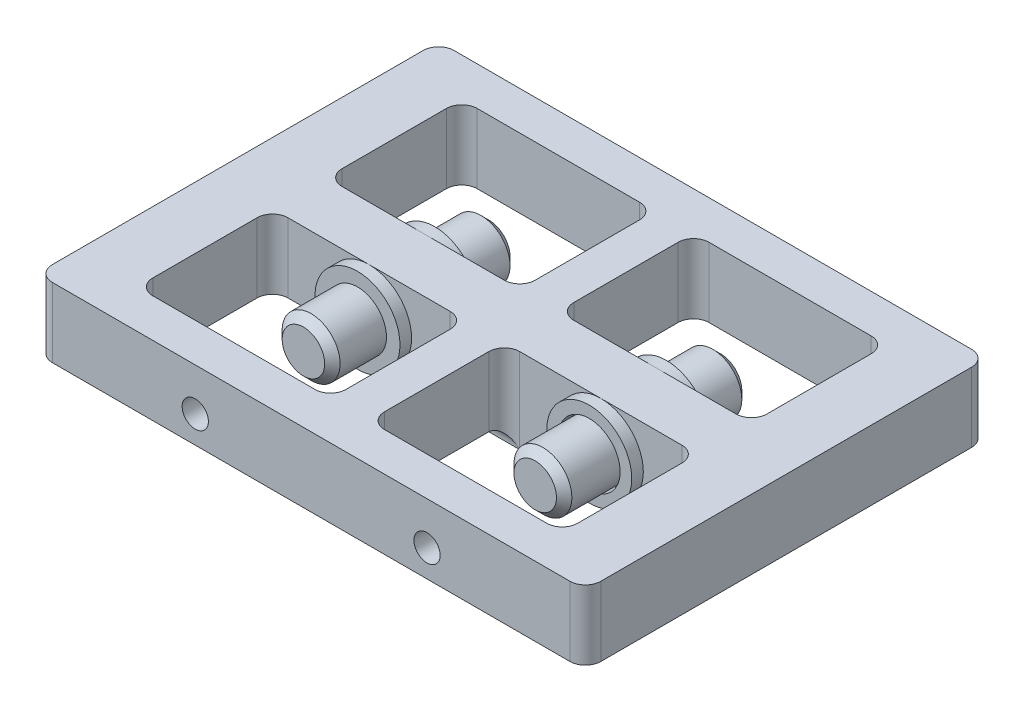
ISO-10303-21;
HEADER;
FILE_DESCRIPTION(('STEP AP214'),'2;1');
FILE_NAME('part.step','',(''),(''),'','','');
FILE_SCHEMA(('AUTOMOTIVE_DESIGN { 1 0 10303 214 1 1 1 1 }'));
ENDSEC;
DATA;
#1=APPLICATION_CONTEXT('core data for automotive mechanical design processes');
#2=APPLICATION_PROTOCOL_DEFINITION('international standard','automotive_design',2000,#1);
#3=PRODUCT_CONTEXT('',#1,'mechanical');
#4=PRODUCT('Part','Part','',(#3));
#5=PRODUCT_RELATED_PRODUCT_CATEGORY('part','',(#4));
#6=PRODUCT_DEFINITION_FORMATION('','',#4);
#7=PRODUCT_DEFINITION_CONTEXT('part definition',#1,'design');
#8=PRODUCT_DEFINITION('design','',#6,#7);
#9=PRODUCT_DEFINITION_SHAPE('','',#8);
#10=(LENGTH_UNIT() NAMED_UNIT(*) SI_UNIT(.MILLI.,.METRE.));
#11=(NAMED_UNIT(*) PLANE_ANGLE_UNIT() SI_UNIT($,.RADIAN.));
#12=(NAMED_UNIT(*) SI_UNIT($,.STERADIAN.) SOLID_ANGLE_UNIT());
#13=UNCERTAINTY_MEASURE_WITH_UNIT(LENGTH_MEASURE(1.E-05),#10,'distance_accuracy_value','');
#14=(GEOMETRIC_REPRESENTATION_CONTEXT(3) GLOBAL_UNCERTAINTY_ASSIGNED_CONTEXT((#13)) GLOBAL_UNIT_ASSIGNED_CONTEXT((#10,
#11,#12)) REPRESENTATION_CONTEXT('',''));
#15=CARTESIAN_POINT('',(0.,0.,0.));
#16=DIRECTION('',(0.,0.,1.));
#17=DIRECTION('',(1.,0.,0.));
#18=AXIS2_PLACEMENT_3D('',#15,#16,#17);
#19=CARTESIAN_POINT('',(0.,5.5,3.50000000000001));
#20=DIRECTION('',(0.,0.,1.));
#21=DIRECTION('',(1.,0.,0.));
#22=AXIS2_PLACEMENT_3D('',#19,#20,#21);
#23=PLANE('',#22);
#24=DIRECTION('',(-1.,0.,0.));
#25=VECTOR('',#24,1.);
#26=CARTESIAN_POINT('',(0.,-5.5,3.50000000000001));
#27=LINE('',#26,#25);
#28=CARTESIAN_POINT('',(-4.5,-5.5,3.50000000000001));
#29=VERTEX_POINT('',#28);
#30=CARTESIAN_POINT('',(-15.,-5.5,3.50000000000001));
#31=VERTEX_POINT('',#30);
#32=EDGE_CURVE('E471',#29,#31,#27,.T.);
#33=ORIENTED_EDGE('',*,*,#32,.F.);
#34=DIRECTION('',(0.,-1.,0.));
#35=VECTOR('',#34,1.);
#36=CARTESIAN_POINT('',(-4.5,5.5,3.50000000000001));
#37=LINE('',#36,#35);
#38=CARTESIAN_POINT('',(-4.5,5.5,3.50000000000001));
#39=VERTEX_POINT('',#38);
#40=EDGE_CURVE('E66',#29,#39,#37,.F.);
#41=ORIENTED_EDGE('',*,*,#40,.T.);
#42=DIRECTION('',(-1.,0.,0.));
#43=VECTOR('',#42,1.);
#44=CARTESIAN_POINT('',(0.,5.5,3.50000000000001));
#45=LINE('',#44,#43);
#46=CARTESIAN_POINT('',(-15.,5.5,3.50000000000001));
#47=VERTEX_POINT('',#46);
#48=EDGE_CURVE('E391',#39,#47,#45,.T.);
#49=ORIENTED_EDGE('',*,*,#48,.T.);
#50=CARTESIAN_POINT('',(-15.,0.,3.50000000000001));
#51=DIRECTION('',(0.,0.,1.));
#52=DIRECTION('',(1.,0.,0.));
#53=AXIS2_PLACEMENT_3D('',#50,#51,#52);
#54=CIRCLE('',#53,5.5);
#55=EDGE_CURVE('E469',#47,#31,#54,.F.);
#56=ORIENTED_EDGE('',*,*,#55,.T.);
#57=EDGE_LOOP('',(#33,#41,#49,#56));
#58=FACE_BOUND('',#57,.T.);
#59=ADVANCED_FACE('F51',(#58),#23,.T.);
#60=CARTESIAN_POINT('',(0.,5.5,-3.5));
#61=DIRECTION('',(0.,0.,-1.));
#62=DIRECTION('',(-1.,0.,0.));
#63=AXIS2_PLACEMENT_3D('',#60,#61,#62);
#64=PLANE('',#63);
#65=DIRECTION('',(1.,0.,0.));
#66=VECTOR('',#65,1.);
#67=CARTESIAN_POINT('',(0.,-5.5,-3.5));
#68=LINE('',#67,#66);
#69=CARTESIAN_POINT('',(4.5,-5.5,-3.5));
#70=VERTEX_POINT('',#69);
#71=CARTESIAN_POINT('',(15.,-5.5,-3.5));
#72=VERTEX_POINT('',#71);
#73=EDGE_CURVE('E481',#70,#72,#68,.T.);
#74=ORIENTED_EDGE('',*,*,#73,.F.);
#75=DIRECTION('',(0.,-1.,0.));
#76=VECTOR('',#75,1.);
#77=CARTESIAN_POINT('',(4.5,5.5,-3.5));
#78=LINE('',#77,#76);
#79=CARTESIAN_POINT('',(4.5,5.5,-3.5));
#80=VERTEX_POINT('',#79);
#81=EDGE_CURVE('E571',#70,#80,#78,.F.);
#82=ORIENTED_EDGE('',*,*,#81,.T.);
#83=DIRECTION('',(1.,0.,0.));
#84=VECTOR('',#83,1.);
#85=CARTESIAN_POINT('',(0.,5.5,-3.5));
#86=LINE('',#85,#84);
#87=CARTESIAN_POINT('',(15.,5.5,-3.5));
#88=VERTEX_POINT('',#87);
#89=EDGE_CURVE('E390',#80,#88,#86,.T.);
#90=ORIENTED_EDGE('',*,*,#89,.T.);
#91=CARTESIAN_POINT('',(15.,0.,-3.5));
#92=DIRECTION('',(0.,0.,-1.));
#93=DIRECTION('',(-1.,0.,0.));
#94=AXIS2_PLACEMENT_3D('',#91,#92,#93);
#95=CIRCLE('',#94,5.5);
#96=EDGE_CURVE('E377',#88,#72,#95,.F.);
#97=ORIENTED_EDGE('',*,*,#96,.T.);
#98=EDGE_LOOP('',(#74,#82,#90,#97));
#99=FACE_BOUND('',#98,.T.);
#100=ADVANCED_FACE('F914',(#99),#64,.T.);
#101=DIRECTION('',(0.,-1.,0.));
#102=VECTOR('',#101,1.);
#103=CARTESIAN_POINT('',(4.5,5.5,3.50000000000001));
#104=LINE('',#103,#102);
#105=CARTESIAN_POINT('',(4.5,5.5,3.50000000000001));
#106=VERTEX_POINT('',#105);
#107=CARTESIAN_POINT('',(4.5,-5.5,3.50000000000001));
#108=VERTEX_POINT('',#107);
#109=EDGE_CURVE('E74',#106,#108,#104,.T.);
#110=ORIENTED_EDGE('',*,*,#109,.T.);
#111=CARTESIAN_POINT('',(15.,-5.5,3.50000000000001));
#112=VERTEX_POINT('',#111);
#113=EDGE_CURVE('E371',#112,#108,#27,.T.);
#114=ORIENTED_EDGE('',*,*,#113,.F.);
#115=CARTESIAN_POINT('',(15.,0.,3.50000000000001));
#116=DIRECTION('',(0.,0.,1.));
#117=DIRECTION('',(1.,0.,0.));
#118=AXIS2_PLACEMENT_3D('',#115,#116,#117);
#119=CIRCLE('',#118,5.5);
#120=CARTESIAN_POINT('',(15.,5.50000000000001,3.50000000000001));
#121=VERTEX_POINT('',#120);
#122=EDGE_CURVE('E366',#112,#121,#119,.F.);
#123=ORIENTED_EDGE('',*,*,#122,.T.);
#124=EDGE_CURVE('E369',#121,#106,#45,.T.);
#125=ORIENTED_EDGE('',*,*,#124,.T.);
#126=EDGE_LOOP('',(#110,#114,#123,#125));
#127=FACE_BOUND('',#126,.T.);
#128=ADVANCED_FACE('F368',(#127),#23,.T.);
#129=DIRECTION('',(0.,-1.,0.));
#130=VECTOR('',#129,1.);
#131=CARTESIAN_POINT('',(-4.5,5.5,-3.5));
#132=LINE('',#131,#130);
#133=CARTESIAN_POINT('',(-4.5,5.5,-3.5));
#134=VERTEX_POINT('',#133);
#135=CARTESIAN_POINT('',(-4.5,-5.5,-3.5));
#136=VERTEX_POINT('',#135);
#137=EDGE_CURVE('E573',#134,#136,#132,.T.);
#138=ORIENTED_EDGE('',*,*,#137,.T.);
#139=CARTESIAN_POINT('',(-15.,-5.5,-3.5));
#140=VERTEX_POINT('',#139);
#141=EDGE_CURVE('E482',#140,#136,#68,.T.);
#142=ORIENTED_EDGE('',*,*,#141,.F.);
#143=CARTESIAN_POINT('',(-15.,0.,-3.5));
#144=DIRECTION('',(0.,0.,-1.));
#145=DIRECTION('',(-1.,0.,0.));
#146=AXIS2_PLACEMENT_3D('',#143,#144,#145);
#147=CIRCLE('',#146,5.5);
#148=CARTESIAN_POINT('',(-15.,5.50000000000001,-3.5));
#149=VERTEX_POINT('',#148);
#150=EDGE_CURVE('E465',#140,#149,#147,.F.);
#151=ORIENTED_EDGE('',*,*,#150,.T.);
#152=EDGE_CURVE('E473',#149,#134,#86,.T.);
#153=ORIENTED_EDGE('',*,*,#152,.T.);
#154=EDGE_LOOP('',(#138,#142,#151,#153));
#155=FACE_BOUND('',#154,.T.);
#156=ADVANCED_FACE('F902',(#155),#64,.T.);
#157=CARTESIAN_POINT('',(-15.,0.,5.));
#158=DIRECTION('',(0.,0.,-1.));
#159=DIRECTION('',(-1.,0.,0.));
#160=AXIS2_PLACEMENT_3D('',#157,#158,#159);
#161=CYLINDRICAL_SURFACE('',#160,5.5);
#162=CARTESIAN_POINT('',(-15.,0.,-5.));
#163=DIRECTION('',(0.,0.,1.));
#164=DIRECTION('',(1.,0.,0.));
#165=AXIS2_PLACEMENT_3D('',#162,#163,#164);
#166=CIRCLE('',#165,5.5);
#167=CARTESIAN_POINT('',(-9.5,0.,-5.));
#168=VERTEX_POINT('',#167);
#169=EDGE_CURVE('E456',#168,#168,#166,.T.);
#170=ORIENTED_EDGE('',*,*,#169,.T.);
#171=EDGE_LOOP('',(#170));
#172=FACE_BOUND('',#171,.T.);
#173=CARTESIAN_POINT('',(-15.,0.,5.));
#174=DIRECTION('',(0.,0.,1.));
#175=DIRECTION('',(1.,0.,0.));
#176=AXIS2_PLACEMENT_3D('',#173,#174,#175);
#177=CIRCLE('',#176,5.5);
#178=CARTESIAN_POINT('',(-9.5,0.,5.));
#179=VERTEX_POINT('',#178);
#180=EDGE_CURVE('E455',#179,#179,#177,.T.);
#181=ORIENTED_EDGE('',*,*,#180,.F.);
#182=EDGE_LOOP('',(#181));
#183=FACE_BOUND('',#182,.T.);
#184=CARTESIAN_POINT('',(-15.,0.,-3.5));
#185=DIRECTION('',(0.,0.,1.));
#186=DIRECTION('',(1.,0.,0.));
#187=AXIS2_PLACEMENT_3D('',#184,#185,#186);
#188=CIRCLE('',#187,5.5);
#189=CARTESIAN_POINT('',(-19.2426406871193,-3.5,-3.5));
#190=VERTEX_POINT('',#189);
#191=EDGE_CURVE('E506',#149,#190,#188,.T.);
#192=ORIENTED_EDGE('',*,*,#191,.F.);
#193=ORIENTED_EDGE('',*,*,#150,.F.);
#194=DIRECTION('',(0.,0.,1.));
#195=VECTOR('',#194,1.);
#196=CARTESIAN_POINT('',(-15.,-5.5,0.));
#197=LINE('',#196,#195);
#198=EDGE_CURVE('E485',#140,#31,#197,.T.);
#199=ORIENTED_EDGE('',*,*,#198,.T.);
#200=ORIENTED_EDGE('',*,*,#55,.F.);
#201=CARTESIAN_POINT('',(-15.,0.,3.50000000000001));
#202=DIRECTION('',(0.,0.,-1.));
#203=DIRECTION('',(-1.,0.,0.));
#204=AXIS2_PLACEMENT_3D('',#201,#202,#203);
#205=CIRCLE('',#204,5.5);
#206=CARTESIAN_POINT('',(-19.2426406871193,-3.5,3.50000000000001));
#207=VERTEX_POINT('',#206);
#208=EDGE_CURVE('E503',#207,#47,#205,.T.);
#209=ORIENTED_EDGE('',*,*,#208,.F.);
#210=DIRECTION('',(0.,0.,-1.));
#211=VECTOR('',#210,1.);
#212=CARTESIAN_POINT('',(-19.2426406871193,-3.5,5.));
#213=LINE('',#212,#211);
#214=EDGE_CURVE('E434',#190,#207,#213,.F.);
#215=ORIENTED_EDGE('',*,*,#214,.F.);
#216=EDGE_LOOP('',(#192,#193,#199,#200,#209,#215));
#217=FACE_BOUND('',#216,.T.);
#218=ADVANCED_FACE('F897',(#172,#183,#217),#161,.T.);
#219=CARTESIAN_POINT('',(15.,0.,5.));
#220=DIRECTION('',(0.,0.,-1.));
#221=DIRECTION('',(-1.,0.,0.));
#222=AXIS2_PLACEMENT_3D('',#219,#220,#221);
#223=CYLINDRICAL_SURFACE('',#222,4.);
#224=CARTESIAN_POINT('',(15.,0.,5.));
#225=DIRECTION('',(0.,0.,1.));
#226=DIRECTION('',(1.,0.,0.));
#227=AXIS2_PLACEMENT_3D('',#224,#225,#226);
#228=CIRCLE('',#227,4.);
#229=CARTESIAN_POINT('',(19.,0.,5.));
#230=VERTEX_POINT('',#229);
#231=EDGE_CURVE('E438',#230,#230,#228,.T.);
#232=ORIENTED_EDGE('',*,*,#231,.T.);
#233=EDGE_LOOP('',(#232));
#234=FACE_BOUND('',#233,.T.);
#235=CARTESIAN_POINT('',(15.,0.,-5.));
#236=DIRECTION('',(0.,0.,1.));
#237=DIRECTION('',(1.,0.,0.));
#238=AXIS2_PLACEMENT_3D('',#235,#236,#237);
#239=CIRCLE('',#238,4.);
#240=CARTESIAN_POINT('',(19.,0.,-5.));
#241=VERTEX_POINT('',#240);
#242=EDGE_CURVE('E437',#241,#241,#239,.T.);
#243=ORIENTED_EDGE('',*,*,#242,.F.);
#244=EDGE_LOOP('',(#243));
#245=FACE_BOUND('',#244,.T.);
#246=DIRECTION('',(0.,0.,-1.));
#247=VECTOR('',#246,1.);
#248=CARTESIAN_POINT('',(16.9364916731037,-3.5,5.));
#249=LINE('',#248,#247);
#250=CARTESIAN_POINT('',(16.9364916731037,-3.5,3.50000000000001));
#251=VERTEX_POINT('',#250);
#252=CARTESIAN_POINT('',(16.9364916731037,-3.5,-3.5));
#253=VERTEX_POINT('',#252);
#254=EDGE_CURVE('E431',#251,#253,#249,.T.);
#255=ORIENTED_EDGE('',*,*,#254,.T.);
#256=CARTESIAN_POINT('',(15.,0.,-3.5));
#257=DIRECTION('',(0.,0.,-1.));
#258=DIRECTION('',(-1.,0.,0.));
#259=AXIS2_PLACEMENT_3D('',#256,#257,#258);
#260=CIRCLE('',#259,4.);
#261=CARTESIAN_POINT('',(15.,-4.,-3.5));
#262=VERTEX_POINT('',#261);
#263=EDGE_CURVE('E501',#253,#262,#260,.F.);
#264=ORIENTED_EDGE('',*,*,#263,.T.);
#265=DIRECTION('',(0.,0.,-1.));
#266=VECTOR('',#265,1.);
#267=CARTESIAN_POINT('',(15.,-4.,5.));
#268=LINE('',#267,#266);
#269=CARTESIAN_POINT('',(15.,-4.,3.50000000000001));
#270=VERTEX_POINT('',#269);
#271=EDGE_CURVE('E376',#262,#270,#268,.F.);
#272=ORIENTED_EDGE('',*,*,#271,.T.);
#273=CARTESIAN_POINT('',(15.,0.,3.50000000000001));
#274=DIRECTION('',(0.,0.,1.));
#275=DIRECTION('',(1.,0.,0.));
#276=AXIS2_PLACEMENT_3D('',#273,#274,#275);
#277=CIRCLE('',#276,4.);
#278=EDGE_CURVE('E453',#270,#251,#277,.F.);
#279=ORIENTED_EDGE('',*,*,#278,.T.);
#280=EDGE_LOOP('',(#255,#264,#272,#279));
#281=FACE_BOUND('',#280,.T.);
#282=ADVANCED_FACE('F977',(#234,#245,#281),#223,.F.);
#283=CARTESIAN_POINT('',(15.,0.,5.));
#284=DIRECTION('',(0.,0.,-1.));
#285=DIRECTION('',(-1.,0.,0.));
#286=AXIS2_PLACEMENT_3D('',#283,#284,#285);
#287=CYLINDRICAL_SURFACE('',#286,5.5);
#288=CARTESIAN_POINT('',(15.,0.,-5.));
#289=DIRECTION('',(0.,0.,1.));
#290=DIRECTION('',(1.,0.,0.));
#291=AXIS2_PLACEMENT_3D('',#288,#289,#290);
#292=CIRCLE('',#291,5.5);
#293=CARTESIAN_POINT('',(20.5,0.,-5.));
#294=VERTEX_POINT('',#293);
#295=EDGE_CURVE('E442',#294,#294,#292,.T.);
#296=ORIENTED_EDGE('',*,*,#295,.T.);
#297=EDGE_LOOP('',(#296));
#298=FACE_BOUND('',#297,.T.);
#299=CARTESIAN_POINT('',(15.,0.,5.));
#300=DIRECTION('',(0.,0.,1.));
#301=DIRECTION('',(1.,0.,0.));
#302=AXIS2_PLACEMENT_3D('',#299,#300,#301);
#303=CIRCLE('',#302,5.5);
#304=CARTESIAN_POINT('',(20.5,0.,5.));
#305=VERTEX_POINT('',#304);
#306=EDGE_CURVE('E441',#305,#305,#303,.T.);
#307=ORIENTED_EDGE('',*,*,#306,.F.);
#308=EDGE_LOOP('',(#307));
#309=FACE_BOUND('',#308,.T.);
#310=CARTESIAN_POINT('',(15.,0.,-3.5));
#311=DIRECTION('',(0.,0.,1.));
#312=DIRECTION('',(1.,0.,0.));
#313=AXIS2_PLACEMENT_3D('',#310,#311,#312);
#314=CIRCLE('',#313,5.5);
#315=CARTESIAN_POINT('',(19.2426406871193,-3.5,-3.5));
#316=VERTEX_POINT('',#315);
#317=EDGE_CURVE('E402',#316,#88,#314,.T.);
#318=ORIENTED_EDGE('',*,*,#317,.F.);
#319=DIRECTION('',(0.,0.,-1.));
#320=VECTOR('',#319,1.);
#321=CARTESIAN_POINT('',(19.2426406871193,-3.5,5.));
#322=LINE('',#321,#320);
#323=CARTESIAN_POINT('',(19.2426406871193,-3.5,3.50000000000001));
#324=VERTEX_POINT('',#323);
#325=EDGE_CURVE('E398',#324,#316,#322,.T.);
#326=ORIENTED_EDGE('',*,*,#325,.F.);
#327=CARTESIAN_POINT('',(15.,0.,3.50000000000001));
#328=DIRECTION('',(0.,0.,-1.));
#329=DIRECTION('',(-1.,0.,0.));
#330=AXIS2_PLACEMENT_3D('',#327,#328,#329);
#331=CIRCLE('',#330,5.5);
#332=EDGE_CURVE('E394',#121,#324,#331,.T.);
#333=ORIENTED_EDGE('',*,*,#332,.F.);
#334=ORIENTED_EDGE('',*,*,#122,.F.);
#335=DIRECTION('',(0.,0.,1.));
#336=VECTOR('',#335,1.);
#337=CARTESIAN_POINT('',(15.,-5.5,0.));
#338=LINE('',#337,#336);
#339=EDGE_CURVE('E478',#72,#112,#338,.T.);
#340=ORIENTED_EDGE('',*,*,#339,.F.);
#341=ORIENTED_EDGE('',*,*,#96,.F.);
#342=EDGE_LOOP('',(#318,#326,#333,#334,#340,#341));
#343=FACE_BOUND('',#342,.T.);
#344=ADVANCED_FACE('F396',(#298,#309,#343),#287,.T.);
#345=CARTESIAN_POINT('',(15.,0.,12.));
#346=DIRECTION('',(0.,0.,-1.));
#347=DIRECTION('',(-1.,0.,0.));
#348=AXIS2_PLACEMENT_3D('',#345,#346,#347);
#349=CYLINDRICAL_SURFACE('',#348,3.75);
#350=CARTESIAN_POINT('',(15.,0.,11.));
#351=DIRECTION('',(0.,0.,1.));
#352=DIRECTION('',(1.,0.,0.));
#353=AXIS2_PLACEMENT_3D('',#350,#351,#352);
#354=CIRCLE('',#353,3.75);
#355=CARTESIAN_POINT('',(18.75,0.,11.));
#356=VERTEX_POINT('',#355);
#357=EDGE_CURVE('E686',#356,#356,#354,.F.);
#358=ORIENTED_EDGE('',*,*,#357,.T.);
#359=EDGE_LOOP('',(#358));
#360=FACE_BOUND('',#359,.T.);
#361=CARTESIAN_POINT('',(15.,0.,-11.));
#362=DIRECTION('',(0.,0.,1.));
#363=DIRECTION('',(1.,0.,0.));
#364=AXIS2_PLACEMENT_3D('',#361,#362,#363);
#365=CIRCLE('',#364,3.75);
#366=CARTESIAN_POINT('',(18.75,0.,-11.));
#367=VERTEX_POINT('',#366);
#368=EDGE_CURVE('E683',#367,#367,#365,.T.);
#369=ORIENTED_EDGE('',*,*,#368,.T.);
#370=EDGE_LOOP('',(#369));
#371=FACE_BOUND('',#370,.T.);
#372=CARTESIAN_POINT('',(15.,0.,-3.5));
#373=DIRECTION('',(0.,0.,-1.));
#374=DIRECTION('',(-1.,0.,0.));
#375=AXIS2_PLACEMENT_3D('',#372,#373,#374);
#376=CIRCLE('',#375,3.75);
#377=CARTESIAN_POINT('',(15.,-3.75,-3.5));
#378=VERTEX_POINT('',#377);
#379=CARTESIAN_POINT('',(16.3462912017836,-3.5,-3.5));
#380=VERTEX_POINT('',#379);
#381=EDGE_CURVE('E494',#378,#380,#376,.T.);
#382=ORIENTED_EDGE('',*,*,#381,.T.);
#383=DIRECTION('',(0.,0.,-1.));
#384=VECTOR('',#383,1.);
#385=CARTESIAN_POINT('',(16.3462912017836,-3.5,12.));
#386=LINE('',#385,#384);
#387=CARTESIAN_POINT('',(16.3462912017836,-3.5,3.50000000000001));
#388=VERTEX_POINT('',#387);
#389=EDGE_CURVE('E427',#388,#380,#386,.T.);
#390=ORIENTED_EDGE('',*,*,#389,.F.);
#391=CARTESIAN_POINT('',(15.,0.,3.50000000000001));
#392=DIRECTION('',(0.,0.,1.));
#393=DIRECTION('',(1.,0.,0.));
#394=AXIS2_PLACEMENT_3D('',#391,#392,#393);
#395=CIRCLE('',#394,3.75);
#396=CARTESIAN_POINT('',(15.,-3.75,3.50000000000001));
#397=VERTEX_POINT('',#396);
#398=EDGE_CURVE('E499',#388,#397,#395,.T.);
#399=ORIENTED_EDGE('',*,*,#398,.T.);
#400=DIRECTION('',(0.,0.,-1.));
#401=VECTOR('',#400,1.);
#402=CARTESIAN_POINT('',(15.,-3.75,12.));
#403=LINE('',#402,#401);
#404=EDGE_CURVE('E496',#397,#378,#403,.T.);
#405=ORIENTED_EDGE('',*,*,#404,.T.);
#406=EDGE_LOOP('',(#382,#390,#399,#405));
#407=FACE_BOUND('',#406,.T.);
#408=ADVANCED_FACE('F999',(#360,#371,#407),#349,.T.);
#409=CARTESIAN_POINT('',(0.,5.5,0.));
#410=DIRECTION('',(0.,1.,0.));
#411=DIRECTION('',(0.,0.,1.));
#412=AXIS2_PLACEMENT_3D('',#409,#410,#411);
#413=PLANE('',#412);
#414=ORIENTED_EDGE('',*,*,#48,.F.);
#415=CARTESIAN_POINT('',(-4.5,5.50000000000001,5.50000000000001));
#416=DIRECTION('',(0.,1.,0.));
#417=DIRECTION('',(0.,0.,1.));
#418=AXIS2_PLACEMENT_3D('',#415,#416,#417);
#419=CIRCLE('',#418,2.);
#420=CARTESIAN_POINT('',(-2.5,5.50000000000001,5.50000000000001));
#421=VERTEX_POINT('',#420);
#422=EDGE_CURVE('E619',#39,#421,#419,.F.);
#423=ORIENTED_EDGE('',*,*,#422,.T.);
#424=DIRECTION('',(0.,0.,1.));
#425=VECTOR('',#424,1.);
#426=CARTESIAN_POINT('',(-2.5,5.50000000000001,3.50000000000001));
#427=LINE('',#426,#425);
#428=CARTESIAN_POINT('',(-2.5,5.50000000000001,19.));
#429=VERTEX_POINT('',#428);
#430=EDGE_CURVE('E423',#421,#429,#427,.T.);
#431=ORIENTED_EDGE('',*,*,#430,.T.);
#432=CARTESIAN_POINT('',(-4.5,5.50000000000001,19.));
#433=DIRECTION('',(0.,1.,0.));
#434=DIRECTION('',(0.,0.,1.));
#435=AXIS2_PLACEMENT_3D('',#432,#433,#434);
#436=CIRCLE('',#435,2.);
#437=CARTESIAN_POINT('',(-4.5,5.50000000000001,21.));
#438=VERTEX_POINT('',#437);
#439=EDGE_CURVE('E623',#429,#438,#436,.F.);
#440=ORIENTED_EDGE('',*,*,#439,.T.);
#441=DIRECTION('',(-1.,0.,0.));
#442=VECTOR('',#441,1.);
#443=CARTESIAN_POINT('',(-2.50000000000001,5.50000000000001,21.));
#444=LINE('',#443,#442);
#445=CARTESIAN_POINT('',(-25.5,5.50000000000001,21.));
#446=VERTEX_POINT('',#445);
#447=EDGE_CURVE('E420',#438,#446,#444,.T.);
#448=ORIENTED_EDGE('',*,*,#447,.T.);
#449=CARTESIAN_POINT('',(-25.5,5.50000000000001,19.));
#450=DIRECTION('',(0.,1.,0.));
#451=DIRECTION('',(0.,0.,1.));
#452=AXIS2_PLACEMENT_3D('',#449,#450,#451);
#453=CIRCLE('',#452,2.);
#454=CARTESIAN_POINT('',(-27.5,5.50000000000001,19.));
#455=VERTEX_POINT('',#454);
#456=EDGE_CURVE('E627',#446,#455,#453,.F.);
#457=ORIENTED_EDGE('',*,*,#456,.T.);
#458=DIRECTION('',(0.,0.,-1.));
#459=VECTOR('',#458,1.);
#460=CARTESIAN_POINT('',(-27.5,5.50000000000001,3.50000000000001));
#461=LINE('',#460,#459);
#462=CARTESIAN_POINT('',(-27.5,5.50000000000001,5.50000000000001));
#463=VERTEX_POINT('',#462);
#464=EDGE_CURVE('E422',#455,#463,#461,.T.);
#465=ORIENTED_EDGE('',*,*,#464,.T.);
#466=CARTESIAN_POINT('',(-25.5,5.50000000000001,5.50000000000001));
#467=DIRECTION('',(0.,1.,0.));
#468=DIRECTION('',(0.,0.,1.));
#469=AXIS2_PLACEMENT_3D('',#466,#467,#468);
#470=CIRCLE('',#469,2.);
#471=CARTESIAN_POINT('',(-25.5,5.50000000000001,3.50000000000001));
#472=VERTEX_POINT('',#471);
#473=EDGE_CURVE('E631',#463,#472,#470,.F.);
#474=ORIENTED_EDGE('',*,*,#473,.T.);
#475=DIRECTION('',(1.,0.,0.));
#476=VECTOR('',#475,1.);
#477=CARTESIAN_POINT('',(-2.5,5.50000000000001,3.50000000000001));
#478=LINE('',#477,#476);
#479=EDGE_CURVE('E805',#472,#47,#478,.T.);
#480=ORIENTED_EDGE('',*,*,#479,.T.);
#481=EDGE_LOOP('',(#414,#423,#431,#440,#448,#457,#465,#474,#480));
#482=FACE_BOUND('',#481,.T.);
#483=ORIENTED_EDGE('',*,*,#89,.F.);
#484=CARTESIAN_POINT('',(4.5,5.50000000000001,-5.5));
#485=DIRECTION('',(0.,1.,0.));
#486=DIRECTION('',(0.,0.,1.));
#487=AXIS2_PLACEMENT_3D('',#484,#485,#486);
#488=CIRCLE('',#487,2.);
#489=CARTESIAN_POINT('',(2.5,5.50000000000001,-5.5));
#490=VERTEX_POINT('',#489);
#491=EDGE_CURVE('E639',#80,#490,#488,.F.);
#492=ORIENTED_EDGE('',*,*,#491,.T.);
#493=DIRECTION('',(0.,0.,-1.));
#494=VECTOR('',#493,1.);
#495=CARTESIAN_POINT('',(2.50000000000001,5.50000000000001,-21.));
#496=LINE('',#495,#494);
#497=CARTESIAN_POINT('',(2.50000000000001,5.50000000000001,-19.));
#498=VERTEX_POINT('',#497);
#499=EDGE_CURVE('E797',#490,#498,#496,.T.);
#500=ORIENTED_EDGE('',*,*,#499,.T.);
#501=CARTESIAN_POINT('',(4.50000000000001,5.50000000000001,-19.));
#502=DIRECTION('',(0.,1.,0.));
#503=DIRECTION('',(0.,0.,1.));
#504=AXIS2_PLACEMENT_3D('',#501,#502,#503);
#505=CIRCLE('',#504,2.);
#506=CARTESIAN_POINT('',(4.50000000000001,5.50000000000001,-21.));
#507=VERTEX_POINT('',#506);
#508=EDGE_CURVE('E643',#498,#507,#505,.F.);
#509=ORIENTED_EDGE('',*,*,#508,.T.);
#510=DIRECTION('',(1.,0.,0.));
#511=VECTOR('',#510,1.);
#512=CARTESIAN_POINT('',(2.50000000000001,5.50000000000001,-21.));
#513=LINE('',#512,#511);
#514=CARTESIAN_POINT('',(25.5,5.50000000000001,-21.));
#515=VERTEX_POINT('',#514);
#516=EDGE_CURVE('E418',#507,#515,#513,.T.);
#517=ORIENTED_EDGE('',*,*,#516,.T.);
#518=CARTESIAN_POINT('',(25.5,5.50000000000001,-19.));
#519=DIRECTION('',(0.,1.,0.));
#520=DIRECTION('',(0.,0.,1.));
#521=AXIS2_PLACEMENT_3D('',#518,#519,#520);
#522=CIRCLE('',#521,2.);
#523=CARTESIAN_POINT('',(27.5,5.50000000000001,-19.));
#524=VERTEX_POINT('',#523);
#525=EDGE_CURVE('E647',#515,#524,#522,.F.);
#526=ORIENTED_EDGE('',*,*,#525,.T.);
#527=DIRECTION('',(0.,0.,1.));
#528=VECTOR('',#527,1.);
#529=CARTESIAN_POINT('',(27.5,5.50000000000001,-21.));
#530=LINE('',#529,#528);
#531=CARTESIAN_POINT('',(27.5,5.50000000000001,-5.5));
#532=VERTEX_POINT('',#531);
#533=EDGE_CURVE('E794',#524,#532,#530,.T.);
#534=ORIENTED_EDGE('',*,*,#533,.T.);
#535=CARTESIAN_POINT('',(25.5,5.50000000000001,-5.5));
#536=DIRECTION('',(0.,1.,0.));
#537=DIRECTION('',(0.,0.,1.));
#538=AXIS2_PLACEMENT_3D('',#535,#536,#537);
#539=CIRCLE('',#538,2.);
#540=CARTESIAN_POINT('',(25.5,5.50000000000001,-3.5));
#541=VERTEX_POINT('',#540);
#542=EDGE_CURVE('E651',#532,#541,#539,.F.);
#543=ORIENTED_EDGE('',*,*,#542,.T.);
#544=DIRECTION('',(-1.,0.,0.));
#545=VECTOR('',#544,1.);
#546=CARTESIAN_POINT('',(2.5,5.50000000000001,-3.5));
#547=LINE('',#546,#545);
#548=EDGE_CURVE('E412',#541,#88,#547,.T.);
#549=ORIENTED_EDGE('',*,*,#548,.T.);
#550=EDGE_LOOP('',(#483,#492,#500,#509,#517,#526,#534,#543,#549));
#551=FACE_BOUND('',#550,.T.);
#552=DIRECTION('',(-1.,0.,0.));
#553=VECTOR('',#552,1.);
#554=CARTESIAN_POINT('',(2.5,5.50000000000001,21.));
#555=LINE('',#554,#553);
#556=CARTESIAN_POINT('',(25.5,5.50000000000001,21.));
#557=VERTEX_POINT('',#556);
#558=CARTESIAN_POINT('',(4.5,5.50000000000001,21.));
#559=VERTEX_POINT('',#558);
#560=EDGE_CURVE('E414',#557,#559,#555,.T.);
#561=ORIENTED_EDGE('',*,*,#560,.T.);
#562=CARTESIAN_POINT('',(4.5,5.50000000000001,19.));
#563=DIRECTION('',(0.,1.,0.));
#564=DIRECTION('',(0.,0.,1.));
#565=AXIS2_PLACEMENT_3D('',#562,#563,#564);
#566=CIRCLE('',#565,2.);
#567=CARTESIAN_POINT('',(2.5,5.50000000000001,19.));
#568=VERTEX_POINT('',#567);
#569=EDGE_CURVE('E663',#559,#568,#566,.F.);
#570=ORIENTED_EDGE('',*,*,#569,.T.);
#571=DIRECTION('',(0.,0.,-1.));
#572=VECTOR('',#571,1.);
#573=CARTESIAN_POINT('',(2.5,5.50000000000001,3.50000000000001));
#574=LINE('',#573,#572);
#575=CARTESIAN_POINT('',(2.5,5.50000000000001,5.50000000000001));
#576=VERTEX_POINT('',#575);
#577=EDGE_CURVE('E409',#568,#576,#574,.T.);
#578=ORIENTED_EDGE('',*,*,#577,.T.);
#579=CARTESIAN_POINT('',(4.5,5.5,5.50000000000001));
#580=DIRECTION('',(0.,1.,0.));
#581=DIRECTION('',(0.,0.,1.));
#582=AXIS2_PLACEMENT_3D('',#579,#580,#581);
#583=CIRCLE('',#582,2.);
#584=EDGE_CURVE('E389',#576,#106,#583,.F.);
#585=ORIENTED_EDGE('',*,*,#584,.T.);
#586=ORIENTED_EDGE('',*,*,#124,.F.);
#587=DIRECTION('',(1.,0.,0.));
#588=VECTOR('',#587,1.);
#589=CARTESIAN_POINT('',(2.5,5.50000000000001,3.50000000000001));
#590=LINE('',#589,#588);
#591=CARTESIAN_POINT('',(25.5,5.50000000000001,3.50000000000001));
#592=VERTEX_POINT('',#591);
#593=EDGE_CURVE('E385',#121,#592,#590,.T.);
#594=ORIENTED_EDGE('',*,*,#593,.T.);
#595=CARTESIAN_POINT('',(25.5,5.50000000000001,5.50000000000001));
#596=DIRECTION('',(0.,1.,0.));
#597=DIRECTION('',(0.,0.,1.));
#598=AXIS2_PLACEMENT_3D('',#595,#596,#597);
#599=CIRCLE('',#598,2.);
#600=CARTESIAN_POINT('',(27.5,5.50000000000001,5.50000000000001));
#601=VERTEX_POINT('',#600);
#602=EDGE_CURVE('E655',#592,#601,#599,.F.);
#603=ORIENTED_EDGE('',*,*,#602,.T.);
#604=DIRECTION('',(0.,0.,1.));
#605=VECTOR('',#604,1.);
#606=CARTESIAN_POINT('',(27.5,5.50000000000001,3.50000000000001));
#607=LINE('',#606,#605);
#608=CARTESIAN_POINT('',(27.5,5.50000000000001,19.));
#609=VERTEX_POINT('',#608);
#610=EDGE_CURVE('E408',#601,#609,#607,.T.);
#611=ORIENTED_EDGE('',*,*,#610,.T.);
#612=CARTESIAN_POINT('',(25.5,5.50000000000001,19.));
#613=DIRECTION('',(0.,1.,0.));
#614=DIRECTION('',(0.,0.,1.));
#615=AXIS2_PLACEMENT_3D('',#612,#613,#614);
#616=CIRCLE('',#615,2.);
#617=EDGE_CURVE('E659',#609,#557,#616,.F.);
#618=ORIENTED_EDGE('',*,*,#617,.T.);
#619=EDGE_LOOP('',(#561,#570,#578,#585,#586,#594,#603,#611,#618));
#620=FACE_BOUND('',#619,.T.);
#621=ORIENTED_EDGE('',*,*,#152,.F.);
#622=DIRECTION('',(-1.,0.,0.));
#623=VECTOR('',#622,1.);
#624=CARTESIAN_POINT('',(-27.5,5.50000000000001,-3.5));
#625=LINE('',#624,#623);
#626=CARTESIAN_POINT('',(-25.5,5.50000000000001,-3.5));
#627=VERTEX_POINT('',#626);
#628=EDGE_CURVE('E791',#149,#627,#625,.T.);
#629=ORIENTED_EDGE('',*,*,#628,.T.);
#630=CARTESIAN_POINT('',(-25.5,5.50000000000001,-5.5));
#631=DIRECTION('',(0.,1.,0.));
#632=DIRECTION('',(0.,0.,1.));
#633=AXIS2_PLACEMENT_3D('',#630,#631,#632);
#634=CIRCLE('',#633,2.);
#635=CARTESIAN_POINT('',(-27.5,5.50000000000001,-5.5));
#636=VERTEX_POINT('',#635);
#637=EDGE_CURVE('E635',#627,#636,#634,.F.);
#638=ORIENTED_EDGE('',*,*,#637,.T.);
#639=DIRECTION('',(0.,0.,-1.));
#640=VECTOR('',#639,1.);
#641=CARTESIAN_POINT('',(-27.5,5.50000000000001,-21.));
#642=LINE('',#641,#640);
#643=CARTESIAN_POINT('',(-27.5,5.50000000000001,-19.));
#644=VERTEX_POINT('',#643);
#645=EDGE_CURVE('E787',#636,#644,#642,.T.);
#646=ORIENTED_EDGE('',*,*,#645,.T.);
#647=CARTESIAN_POINT('',(-25.5,5.50000000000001,-19.));
#648=DIRECTION('',(0.,1.,0.));
#649=DIRECTION('',(0.,0.,1.));
#650=AXIS2_PLACEMENT_3D('',#647,#648,#649);
#651=CIRCLE('',#650,2.);
#652=CARTESIAN_POINT('',(-25.5,5.50000000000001,-21.));
#653=VERTEX_POINT('',#652);
#654=EDGE_CURVE('E672',#644,#653,#651,.F.);
#655=ORIENTED_EDGE('',*,*,#654,.T.);
#656=DIRECTION('',(1.,0.,0.));
#657=VECTOR('',#656,1.);
#658=CARTESIAN_POINT('',(-27.5,5.50000000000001,-21.));
#659=LINE('',#658,#657);
#660=CARTESIAN_POINT('',(-4.5,5.50000000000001,-21.));
#661=VERTEX_POINT('',#660);
#662=EDGE_CURVE('E790',#653,#661,#659,.T.);
#663=ORIENTED_EDGE('',*,*,#662,.T.);
#664=CARTESIAN_POINT('',(-4.5,5.50000000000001,-19.));
#665=DIRECTION('',(0.,1.,0.));
#666=DIRECTION('',(0.,0.,1.));
#667=AXIS2_PLACEMENT_3D('',#664,#665,#666);
#668=CIRCLE('',#667,2.);
#669=CARTESIAN_POINT('',(-2.5,5.50000000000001,-19.));
#670=VERTEX_POINT('',#669);
#671=EDGE_CURVE('E668',#661,#670,#668,.F.);
#672=ORIENTED_EDGE('',*,*,#671,.T.);
#673=DIRECTION('',(0.,0.,1.));
#674=VECTOR('',#673,1.);
#675=CARTESIAN_POINT('',(-2.5,5.50000000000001,-21.));
#676=LINE('',#675,#674);
#677=CARTESIAN_POINT('',(-2.5,5.50000000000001,-5.5));
#678=VERTEX_POINT('',#677);
#679=EDGE_CURVE('E403',#670,#678,#676,.T.);
#680=ORIENTED_EDGE('',*,*,#679,.T.);
#681=CARTESIAN_POINT('',(-4.5,5.5,-5.5));
#682=DIRECTION('',(0.,1.,0.));
#683=DIRECTION('',(0.,0.,1.));
#684=AXIS2_PLACEMENT_3D('',#681,#682,#683);
#685=CIRCLE('',#684,2.);
#686=EDGE_CURVE('E637',#678,#134,#685,.F.);
#687=ORIENTED_EDGE('',*,*,#686,.T.);
#688=EDGE_LOOP('',(#621,#629,#638,#646,#655,#663,#672,#680,#687));
#689=FACE_BOUND('',#688,.T.);
#690=DIRECTION('',(0.,0.,1.));
#691=VECTOR('',#690,1.);
#692=CARTESIAN_POINT('',(35.5,5.50000000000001,-26.));
#693=LINE('',#692,#691);
#694=CARTESIAN_POINT('',(35.5,5.50000000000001,-24.));
#695=VERTEX_POINT('',#694);
#696=CARTESIAN_POINT('',(35.5,5.50000000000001,24.));
#697=VERTEX_POINT('',#696);
#698=EDGE_CURVE('E786',#695,#697,#693,.T.);
#699=ORIENTED_EDGE('',*,*,#698,.F.);
#700=CARTESIAN_POINT('',(33.5,5.50000000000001,-24.));
#701=DIRECTION('',(0.,1.,0.));
#702=DIRECTION('',(0.,0.,1.));
#703=AXIS2_PLACEMENT_3D('',#700,#701,#702);
#704=CIRCLE('',#703,2.);
#705=CARTESIAN_POINT('',(33.5,5.50000000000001,-26.));
#706=VERTEX_POINT('',#705);
#707=EDGE_CURVE('E532',#695,#706,#704,.T.);
#708=ORIENTED_EDGE('',*,*,#707,.T.);
#709=DIRECTION('',(1.,0.,0.));
#710=VECTOR('',#709,1.);
#711=CARTESIAN_POINT('',(-35.5,5.50000000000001,-26.));
#712=LINE('',#711,#710);
#713=CARTESIAN_POINT('',(-33.5,5.50000000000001,-26.));
#714=VERTEX_POINT('',#713);
#715=EDGE_CURVE('E783',#714,#706,#712,.T.);
#716=ORIENTED_EDGE('',*,*,#715,.F.);
#717=CARTESIAN_POINT('',(-33.5,5.50000000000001,-24.));
#718=DIRECTION('',(0.,1.,0.));
#719=DIRECTION('',(0.,0.,1.));
#720=AXIS2_PLACEMENT_3D('',#717,#718,#719);
#721=CIRCLE('',#720,2.);
#722=CARTESIAN_POINT('',(-35.5,5.50000000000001,-24.));
#723=VERTEX_POINT('',#722);
#724=EDGE_CURVE('E530',#714,#723,#721,.T.);
#725=ORIENTED_EDGE('',*,*,#724,.T.);
#726=DIRECTION('',(0.,0.,-1.));
#727=VECTOR('',#726,1.);
#728=CARTESIAN_POINT('',(-35.5,5.50000000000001,-26.));
#729=LINE('',#728,#727);
#730=CARTESIAN_POINT('',(-35.5,5.50000000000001,24.));
#731=VERTEX_POINT('',#730);
#732=EDGE_CURVE('E810',#731,#723,#729,.T.);
#733=ORIENTED_EDGE('',*,*,#732,.F.);
#734=CARTESIAN_POINT('',(-33.5,5.50000000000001,24.));
#735=DIRECTION('',(0.,1.,0.));
#736=DIRECTION('',(0.,0.,1.));
#737=AXIS2_PLACEMENT_3D('',#734,#735,#736);
#738=CIRCLE('',#737,2.);
#739=CARTESIAN_POINT('',(-33.5,5.50000000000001,26.));
#740=VERTEX_POINT('',#739);
#741=EDGE_CURVE('E526',#731,#740,#738,.T.);
#742=ORIENTED_EDGE('',*,*,#741,.T.);
#743=DIRECTION('',(-1.,0.,0.));
#744=VECTOR('',#743,1.);
#745=CARTESIAN_POINT('',(-35.5,5.50000000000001,26.));
#746=LINE('',#745,#744);
#747=CARTESIAN_POINT('',(33.5,5.50000000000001,26.));
#748=VERTEX_POINT('',#747);
#749=EDGE_CURVE('E813',#748,#740,#746,.T.);
#750=ORIENTED_EDGE('',*,*,#749,.F.);
#751=CARTESIAN_POINT('',(33.5,5.50000000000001,24.));
#752=DIRECTION('',(0.,1.,0.));
#753=DIRECTION('',(0.,0.,1.));
#754=AXIS2_PLACEMENT_3D('',#751,#752,#753);
#755=CIRCLE('',#754,2.);
#756=EDGE_CURVE('E528',#748,#697,#755,.T.);
#757=ORIENTED_EDGE('',*,*,#756,.T.);
#758=EDGE_LOOP('',(#699,#708,#716,#725,#733,#742,#750,#757));
#759=FACE_BOUND('',#758,.T.);
#760=ADVANCED_FACE('F382',(#482,#551,#620,#689,#759),#413,.T.);
#761=CARTESIAN_POINT('',(0.,-5.5,0.));
#762=DIRECTION('',(0.,1.,0.));
#763=DIRECTION('',(0.,0.,1.));
#764=AXIS2_PLACEMENT_3D('',#761,#762,#763);
#765=PLANE('',#764);
#766=ORIENTED_EDGE('',*,*,#113,.T.);
#767=EDGE_CURVE('E479',#108,#29,#27,.T.);
#768=ORIENTED_EDGE('',*,*,#767,.T.);
#769=ORIENTED_EDGE('',*,*,#32,.T.);
#770=ORIENTED_EDGE('',*,*,#198,.F.);
#771=ORIENTED_EDGE('',*,*,#141,.T.);
#772=EDGE_CURVE('E486',#136,#70,#68,.T.);
#773=ORIENTED_EDGE('',*,*,#772,.T.);
#774=ORIENTED_EDGE('',*,*,#73,.T.);
#775=ORIENTED_EDGE('',*,*,#339,.T.);
#776=EDGE_LOOP('',(#766,#768,#769,#770,#771,#773,#774,#775));
#777=FACE_BOUND('',#776,.T.);
#778=ADVANCED_FACE('F736',(#777),#765,.F.);
#779=CARTESIAN_POINT('',(-15.,0.,12.));
#780=DIRECTION('',(0.,0.,-1.));
#781=DIRECTION('',(-1.,0.,0.));
#782=AXIS2_PLACEMENT_3D('',#779,#780,#781);
#783=CYLINDRICAL_SURFACE('',#782,3.75);
#784=CARTESIAN_POINT('',(-15.,0.,11.));
#785=DIRECTION('',(0.,0.,1.));
#786=DIRECTION('',(1.,0.,0.));
#787=AXIS2_PLACEMENT_3D('',#784,#785,#786);
#788=CIRCLE('',#787,3.75);
#789=CARTESIAN_POINT('',(-11.25,0.,11.));
#790=VERTEX_POINT('',#789);
#791=EDGE_CURVE('E677',#790,#790,#788,.F.);
#792=ORIENTED_EDGE('',*,*,#791,.T.);
#793=EDGE_LOOP('',(#792));
#794=FACE_BOUND('',#793,.T.);
#795=CARTESIAN_POINT('',(-15.,0.,5.));
#796=DIRECTION('',(0.,0.,1.));
#797=DIRECTION('',(1.,0.,0.));
#798=AXIS2_PLACEMENT_3D('',#795,#796,#797);
#799=CIRCLE('',#798,3.75);
#800=CARTESIAN_POINT('',(-11.25,0.,5.));
#801=VERTEX_POINT('',#800);
#802=EDGE_CURVE('E459',#801,#801,#799,.T.);
#803=ORIENTED_EDGE('',*,*,#802,.T.);
#804=EDGE_LOOP('',(#803));
#805=FACE_BOUND('',#804,.T.);
#806=ADVANCED_FACE('F1027',(#794,#805),#783,.T.);
#807=CARTESIAN_POINT('',(0.,0.,12.));
#808=DIRECTION('',(0.,0.,1.));
#809=DIRECTION('',(1.,0.,0.));
#810=AXIS2_PLACEMENT_3D('',#807,#808,#809);
#811=PLANE('',#810);
#812=CARTESIAN_POINT('',(-15.,0.,12.));
#813=DIRECTION('',(0.,0.,1.));
#814=DIRECTION('',(1.,0.,0.));
#815=AXIS2_PLACEMENT_3D('',#812,#813,#814);
#816=CIRCLE('',#815,2.75);
#817=CARTESIAN_POINT('',(-12.25,0.,12.));
#818=VERTEX_POINT('',#817);
#819=EDGE_CURVE('E674',#818,#818,#816,.T.);
#820=ORIENTED_EDGE('',*,*,#819,.T.);
#821=EDGE_LOOP('',(#820));
#822=FACE_BOUND('',#821,.T.);
#823=ADVANCED_FACE('F1023',(#822),#811,.T.);
#824=CARTESIAN_POINT('',(-15.,0.,5.));
#825=DIRECTION('',(0.,0.,1.));
#826=DIRECTION('',(1.,0.,0.));
#827=AXIS2_PLACEMENT_3D('',#824,#825,#826);
#828=PLANE('',#827);
#829=ORIENTED_EDGE('',*,*,#802,.F.);
#830=EDGE_LOOP('',(#829));
#831=FACE_BOUND('',#830,.T.);
#832=ORIENTED_EDGE('',*,*,#180,.T.);
#833=EDGE_LOOP('',(#832));
#834=FACE_BOUND('',#833,.T.);
#835=ADVANCED_FACE('F1019',(#831,#834),#828,.T.);
#836=CARTESIAN_POINT('',(-15.,0.,-5.));
#837=DIRECTION('',(0.,0.,1.));
#838=DIRECTION('',(1.,0.,0.));
#839=AXIS2_PLACEMENT_3D('',#836,#837,#838);
#840=PLANE('',#839);
#841=CARTESIAN_POINT('',(-15.,0.,-5.));
#842=DIRECTION('',(0.,0.,1.));
#843=DIRECTION('',(1.,0.,0.));
#844=AXIS2_PLACEMENT_3D('',#841,#842,#843);
#845=CIRCLE('',#844,3.75);
#846=CARTESIAN_POINT('',(-11.25,0.,-5.));
#847=VERTEX_POINT('',#846);
#848=EDGE_CURVE('E462',#847,#847,#845,.T.);
#849=ORIENTED_EDGE('',*,*,#848,.T.);
#850=EDGE_LOOP('',(#849));
#851=FACE_BOUND('',#850,.T.);
#852=ORIENTED_EDGE('',*,*,#169,.F.);
#853=EDGE_LOOP('',(#852));
#854=FACE_BOUND('',#853,.T.);
#855=ADVANCED_FACE('F1015',(#851,#854),#840,.F.);
#856=CARTESIAN_POINT('',(0.,0.,-12.));
#857=DIRECTION('',(0.,0.,1.));
#858=DIRECTION('',(1.,0.,0.));
#859=AXIS2_PLACEMENT_3D('',#856,#857,#858);
#860=PLANE('',#859);
#861=CARTESIAN_POINT('',(-15.,0.,-12.));
#862=DIRECTION('',(0.,0.,1.));
#863=DIRECTION('',(1.,0.,0.));
#864=AXIS2_PLACEMENT_3D('',#861,#862,#863);
#865=CIRCLE('',#864,2.75000000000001);
#866=CARTESIAN_POINT('',(-12.25,0.,-12.));
#867=VERTEX_POINT('',#866);
#868=EDGE_CURVE('E695',#867,#867,#865,.F.);
#869=ORIENTED_EDGE('',*,*,#868,.T.);
#870=EDGE_LOOP('',(#869));
#871=FACE_BOUND('',#870,.T.);
#872=ADVANCED_FACE('F1018',(#871),#860,.F.);
#873=CARTESIAN_POINT('',(-15.,0.,-11.));
#874=DIRECTION('',(0.,0.,1.));
#875=DIRECTION('',(1.,0.,0.));
#876=AXIS2_PLACEMENT_3D('',#873,#874,#875);
#877=CIRCLE('',#876,3.75);
#878=CARTESIAN_POINT('',(-11.25,0.,-11.));
#879=VERTEX_POINT('',#878);
#880=EDGE_CURVE('E692',#879,#879,#877,.T.);
#881=ORIENTED_EDGE('',*,*,#880,.T.);
#882=EDGE_LOOP('',(#881));
#883=FACE_BOUND('',#882,.T.);
#884=ORIENTED_EDGE('',*,*,#848,.F.);
#885=EDGE_LOOP('',(#884));
#886=FACE_BOUND('',#885,.T.);
#887=ADVANCED_FACE('F1031',(#883,#886),#783,.T.);
#888=CARTESIAN_POINT('',(0.,0.,5.));
#889=DIRECTION('',(0.,0.,1.));
#890=DIRECTION('',(1.,0.,0.));
#891=AXIS2_PLACEMENT_3D('',#888,#889,#890);
#892=PLANE('',#891);
#893=ORIENTED_EDGE('',*,*,#231,.F.);
#894=EDGE_LOOP('',(#893));
#895=FACE_BOUND('',#894,.T.);
#896=ORIENTED_EDGE('',*,*,#306,.T.);
#897=EDGE_LOOP('',(#896));
#898=FACE_BOUND('',#897,.T.);
#899=ADVANCED_FACE('F1514',(#895,#898),#892,.T.);
#900=CARTESIAN_POINT('',(0.,0.,-5.));
#901=DIRECTION('',(0.,0.,1.));
#902=DIRECTION('',(1.,0.,0.));
#903=AXIS2_PLACEMENT_3D('',#900,#901,#902);
#904=PLANE('',#903);
#905=ORIENTED_EDGE('',*,*,#242,.T.);
#906=EDGE_LOOP('',(#905));
#907=FACE_BOUND('',#906,.T.);
#908=ORIENTED_EDGE('',*,*,#295,.F.);
#909=EDGE_LOOP('',(#908));
#910=FACE_BOUND('',#909,.T.);
#911=ADVANCED_FACE('F1510',(#907,#910),#904,.F.);
#912=CARTESIAN_POINT('',(0.,0.,-12.));
#913=DIRECTION('',(0.,0.,1.));
#914=DIRECTION('',(1.,0.,0.));
#915=AXIS2_PLACEMENT_3D('',#912,#913,#914);
#916=PLANE('',#915);
#917=CARTESIAN_POINT('',(15.,0.,-12.));
#918=DIRECTION('',(0.,0.,1.));
#919=DIRECTION('',(1.,0.,0.));
#920=AXIS2_PLACEMENT_3D('',#917,#918,#919);
#921=CIRCLE('',#920,2.75000000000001);
#922=CARTESIAN_POINT('',(17.75,0.,-12.));
#923=VERTEX_POINT('',#922);
#924=EDGE_CURVE('E689',#923,#923,#921,.F.);
#925=ORIENTED_EDGE('',*,*,#924,.T.);
#926=EDGE_LOOP('',(#925));
#927=FACE_BOUND('',#926,.T.);
#928=ADVANCED_FACE('F988',(#927),#916,.F.);
#929=CARTESIAN_POINT('',(0.,0.,12.));
#930=DIRECTION('',(0.,0.,1.));
#931=DIRECTION('',(1.,0.,0.));
#932=AXIS2_PLACEMENT_3D('',#929,#930,#931);
#933=PLANE('',#932);
#934=CARTESIAN_POINT('',(15.,0.,12.));
#935=DIRECTION('',(0.,0.,1.));
#936=DIRECTION('',(1.,0.,0.));
#937=AXIS2_PLACEMENT_3D('',#934,#935,#936);
#938=CIRCLE('',#937,2.75000000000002);
#939=CARTESIAN_POINT('',(17.75,0.,12.));
#940=VERTEX_POINT('',#939);
#941=EDGE_CURVE('E680',#940,#940,#938,.T.);
#942=ORIENTED_EDGE('',*,*,#941,.T.);
#943=EDGE_LOOP('',(#942));
#944=FACE_BOUND('',#943,.T.);
#945=ADVANCED_FACE('F982',(#944),#933,.T.);
#946=DIRECTION('',(-1.,0.,0.));
#947=VECTOR('',#946,1.);
#948=CARTESIAN_POINT('',(2.5,-3.5,-3.5));
#949=LINE('',#948,#947);
#950=EDGE_CURVE('E749',#253,#380,#949,.T.);
#951=ORIENTED_EDGE('',*,*,#950,.T.);
#952=ORIENTED_EDGE('',*,*,#381,.F.);
#953=DIRECTION('',(0.,-1.,0.));
#954=VECTOR('',#953,1.);
#955=CARTESIAN_POINT('',(15.,5.5,-3.5));
#956=LINE('',#955,#954);
#957=EDGE_CURVE('E476',#378,#262,#956,.T.);
#958=ORIENTED_EDGE('',*,*,#957,.T.);
#959=ORIENTED_EDGE('',*,*,#263,.F.);
#960=EDGE_LOOP('',(#951,#952,#958,#959));
#961=FACE_BOUND('',#960,.T.);
#962=ADVANCED_FACE('F963',(#961),#64,.T.);
#963=DIRECTION('',(1.,0.,0.));
#964=VECTOR('',#963,1.);
#965=CARTESIAN_POINT('',(2.5,-3.5,3.50000000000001));
#966=LINE('',#965,#964);
#967=EDGE_CURVE('E728',#388,#251,#966,.T.);
#968=ORIENTED_EDGE('',*,*,#967,.T.);
#969=ORIENTED_EDGE('',*,*,#278,.F.);
#970=DIRECTION('',(0.,-1.,0.));
#971=VECTOR('',#970,1.);
#972=CARTESIAN_POINT('',(15.,5.5,3.50000000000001));
#973=LINE('',#972,#971);
#974=EDGE_CURVE('E491',#397,#270,#973,.T.);
#975=ORIENTED_EDGE('',*,*,#974,.F.);
#976=ORIENTED_EDGE('',*,*,#398,.F.);
#977=EDGE_LOOP('',(#968,#969,#975,#976));
#978=FACE_BOUND('',#977,.T.);
#979=ADVANCED_FACE('F957',(#978),#23,.T.);
#980=CARTESIAN_POINT('',(15.,5.5,0.));
#981=DIRECTION('',(1.,0.,0.));
#982=DIRECTION('',(0.,0.,-1.));
#983=AXIS2_PLACEMENT_3D('',#980,#981,#982);
#984=PLANE('',#983);
#985=ORIENTED_EDGE('',*,*,#271,.F.);
#986=ORIENTED_EDGE('',*,*,#957,.F.);
#987=ORIENTED_EDGE('',*,*,#404,.F.);
#988=ORIENTED_EDGE('',*,*,#974,.T.);
#989=EDGE_LOOP('',(#985,#986,#987,#988));
#990=FACE_BOUND('',#989,.T.);
#991=ADVANCED_FACE('F967',(#990),#984,.T.);
#992=CARTESIAN_POINT('',(0.,-3.5,0.));
#993=DIRECTION('',(0.,1.,0.));
#994=DIRECTION('',(0.,0.,1.));
#995=AXIS2_PLACEMENT_3D('',#992,#993,#994);
#996=PLANE('',#995);
#997=ORIENTED_EDGE('',*,*,#254,.F.);
#998=ORIENTED_EDGE('',*,*,#967,.F.);
#999=ORIENTED_EDGE('',*,*,#389,.T.);
#1000=ORIENTED_EDGE('',*,*,#950,.F.);
#1001=EDGE_LOOP('',(#997,#998,#999,#1000));
#1002=FACE_BOUND('',#1001,.T.);
#1003=ADVANCED_FACE('F994',(#1002),#996,.F.);
#1004=CARTESIAN_POINT('',(-27.5,93.5056816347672,-3.5));
#1005=DIRECTION('',(0.,0.,1.));
#1006=DIRECTION('',(1.,0.,0.));
#1007=AXIS2_PLACEMENT_3D('',#1004,#1005,#1006);
#1008=PLANE('',#1007);
#1009=DIRECTION('',(-1.,0.,0.));
#1010=VECTOR('',#1009,1.);
#1011=CARTESIAN_POINT('',(-27.5,-3.5,-3.5));
#1012=LINE('',#1011,#1010);
#1013=CARTESIAN_POINT('',(-25.5,-3.5,-3.5));
#1014=VERTEX_POINT('',#1013);
#1015=EDGE_CURVE('E840',#190,#1014,#1012,.T.);
#1016=ORIENTED_EDGE('',*,*,#1015,.T.);
#1017=DIRECTION('',(0.,-1.,0.));
#1018=VECTOR('',#1017,1.);
#1019=CARTESIAN_POINT('',(-25.5,5.50000000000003,-3.5));
#1020=LINE('',#1019,#1018);
#1021=EDGE_CURVE('E569',#1014,#627,#1020,.F.);
#1022=ORIENTED_EDGE('',*,*,#1021,.T.);
#1023=ORIENTED_EDGE('',*,*,#628,.F.);
#1024=ORIENTED_EDGE('',*,*,#191,.T.);
#1025=EDGE_LOOP('',(#1016,#1022,#1023,#1024));
#1026=FACE_BOUND('',#1025,.T.);
#1027=ADVANCED_FACE('F1048',(#1026),#1008,.F.);
#1028=DIRECTION('',(0.,0.,-1.));
#1029=VECTOR('',#1028,1.);
#1030=CARTESIAN_POINT('',(2.50000000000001,-3.5,-21.));
#1031=LINE('',#1030,#1029);
#1032=CARTESIAN_POINT('',(2.5,-3.5,-5.5));
#1033=VERTEX_POINT('',#1032);
#1034=CARTESIAN_POINT('',(2.50000000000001,-3.5,-19.));
#1035=VERTEX_POINT('',#1034);
#1036=EDGE_CURVE('E755',#1033,#1035,#1031,.T.);
#1037=ORIENTED_EDGE('',*,*,#1036,.F.);
#1038=DIRECTION('',(1.,0.,0.));
#1039=VECTOR('',#1038,1.);
#1040=CARTESIAN_POINT('',(0.,-3.5,-5.5));
#1041=LINE('',#1040,#1039);
#1042=CARTESIAN_POINT('',(-2.5,-3.5,-5.5));
#1043=VERTEX_POINT('',#1042);
#1044=EDGE_CURVE('E700',#1033,#1043,#1041,.F.);
#1045=ORIENTED_EDGE('',*,*,#1044,.T.);
#1046=DIRECTION('',(0.,0.,1.));
#1047=VECTOR('',#1046,1.);
#1048=CARTESIAN_POINT('',(-2.5,-3.5,-21.));
#1049=LINE('',#1048,#1047);
#1050=CARTESIAN_POINT('',(-2.5,-3.5,-19.));
#1051=VERTEX_POINT('',#1050);
#1052=EDGE_CURVE('E835',#1051,#1043,#1049,.T.);
#1053=ORIENTED_EDGE('',*,*,#1052,.F.);
#1054=CARTESIAN_POINT('',(-4.5,-3.5,-19.));
#1055=DIRECTION('',(0.,1.,0.));
#1056=DIRECTION('',(0.,0.,1.));
#1057=AXIS2_PLACEMENT_3D('',#1054,#1055,#1056);
#1058=CIRCLE('',#1057,2.);
#1059=CARTESIAN_POINT('',(-4.5,-3.5,-21.));
#1060=VERTEX_POINT('',#1059);
#1061=EDGE_CURVE('E666',#1051,#1060,#1058,.T.);
#1062=ORIENTED_EDGE('',*,*,#1061,.T.);
#1063=DIRECTION('',(1.,0.,0.));
#1064=VECTOR('',#1063,1.);
#1065=CARTESIAN_POINT('',(-27.5,-3.5,-21.));
#1066=LINE('',#1065,#1064);
#1067=CARTESIAN_POINT('',(-25.5,-3.5,-21.));
#1068=VERTEX_POINT('',#1067);
#1069=EDGE_CURVE('E765',#1068,#1060,#1066,.T.);
#1070=ORIENTED_EDGE('',*,*,#1069,.F.);
#1071=CARTESIAN_POINT('',(-25.5,-3.5,-19.));
#1072=DIRECTION('',(0.,1.,0.));
#1073=DIRECTION('',(0.,0.,1.));
#1074=AXIS2_PLACEMENT_3D('',#1071,#1072,#1073);
#1075=CIRCLE('',#1074,2.);
#1076=CARTESIAN_POINT('',(-27.5,-3.5,-19.));
#1077=VERTEX_POINT('',#1076);
#1078=EDGE_CURVE('E670',#1068,#1077,#1075,.T.);
#1079=ORIENTED_EDGE('',*,*,#1078,.T.);
#1080=DIRECTION('',(0.,0.,-1.));
#1081=VECTOR('',#1080,1.);
#1082=CARTESIAN_POINT('',(-27.5,-3.5,-21.));
#1083=LINE('',#1082,#1081);
#1084=CARTESIAN_POINT('',(-27.5,-3.5,-5.5));
#1085=VERTEX_POINT('',#1084);
#1086=EDGE_CURVE('E757',#1085,#1077,#1083,.T.);
#1087=ORIENTED_EDGE('',*,*,#1086,.F.);
#1088=CARTESIAN_POINT('',(-25.5,-3.5,-5.5));
#1089=DIRECTION('',(0.,1.,0.));
#1090=DIRECTION('',(0.,0.,1.));
#1091=AXIS2_PLACEMENT_3D('',#1088,#1089,#1090);
#1092=CIRCLE('',#1091,2.);
#1093=EDGE_CURVE('E633',#1085,#1014,#1092,.T.);
#1094=ORIENTED_EDGE('',*,*,#1093,.T.);
#1095=ORIENTED_EDGE('',*,*,#1015,.F.);
#1096=ORIENTED_EDGE('',*,*,#214,.T.);
#1097=DIRECTION('',(1.,0.,0.));
#1098=VECTOR('',#1097,1.);
#1099=CARTESIAN_POINT('',(-2.5,-3.5,3.50000000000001));
#1100=LINE('',#1099,#1098);
#1101=CARTESIAN_POINT('',(-25.5,-3.5,3.50000000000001));
#1102=VERTEX_POINT('',#1101);
#1103=EDGE_CURVE('E727',#1102,#207,#1100,.T.);
#1104=ORIENTED_EDGE('',*,*,#1103,.F.);
#1105=CARTESIAN_POINT('',(-25.5,-3.5,5.50000000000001));
#1106=DIRECTION('',(0.,1.,0.));
#1107=DIRECTION('',(0.,0.,1.));
#1108=AXIS2_PLACEMENT_3D('',#1105,#1106,#1107);
#1109=CIRCLE('',#1108,2.);
#1110=CARTESIAN_POINT('',(-27.5,-3.5,5.50000000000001));
#1111=VERTEX_POINT('',#1110);
#1112=EDGE_CURVE('E629',#1102,#1111,#1109,.T.);
#1113=ORIENTED_EDGE('',*,*,#1112,.T.);
#1114=DIRECTION('',(0.,0.,-1.));
#1115=VECTOR('',#1114,1.);
#1116=CARTESIAN_POINT('',(-27.5,-3.5,3.50000000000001));
#1117=LINE('',#1116,#1115);
#1118=CARTESIAN_POINT('',(-27.5,-3.5,19.));
#1119=VERTEX_POINT('',#1118);
#1120=EDGE_CURVE('E776',#1119,#1111,#1117,.T.);
#1121=ORIENTED_EDGE('',*,*,#1120,.F.);
#1122=CARTESIAN_POINT('',(-25.5,-3.5,19.));
#1123=DIRECTION('',(0.,1.,0.));
#1124=DIRECTION('',(0.,0.,1.));
#1125=AXIS2_PLACEMENT_3D('',#1122,#1123,#1124);
#1126=CIRCLE('',#1125,2.);
#1127=CARTESIAN_POINT('',(-25.5,-3.5,21.));
#1128=VERTEX_POINT('',#1127);
#1129=EDGE_CURVE('E625',#1119,#1128,#1126,.T.);
#1130=ORIENTED_EDGE('',*,*,#1129,.T.);
#1131=DIRECTION('',(-1.,0.,0.));
#1132=VECTOR('',#1131,1.);
#1133=CARTESIAN_POINT('',(-2.50000000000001,-3.5,21.));
#1134=LINE('',#1133,#1132);
#1135=CARTESIAN_POINT('',(-4.5,-3.5,21.));
#1136=VERTEX_POINT('',#1135);
#1137=EDGE_CURVE('E779',#1136,#1128,#1134,.T.);
#1138=ORIENTED_EDGE('',*,*,#1137,.F.);
#1139=CARTESIAN_POINT('',(-4.5,-3.5,19.));
#1140=DIRECTION('',(0.,1.,0.));
#1141=DIRECTION('',(0.,0.,1.));
#1142=AXIS2_PLACEMENT_3D('',#1139,#1140,#1141);
#1143=CIRCLE('',#1142,2.);
#1144=CARTESIAN_POINT('',(-2.5,-3.5,19.));
#1145=VERTEX_POINT('',#1144);
#1146=EDGE_CURVE('E621',#1136,#1145,#1143,.T.);
#1147=ORIENTED_EDGE('',*,*,#1146,.T.);
#1148=DIRECTION('',(0.,0.,1.));
#1149=VECTOR('',#1148,1.);
#1150=CARTESIAN_POINT('',(-2.5,-3.5,3.50000000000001));
#1151=LINE('',#1150,#1149);
#1152=CARTESIAN_POINT('',(-2.5,-3.5,5.50000000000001));
#1153=VERTEX_POINT('',#1152);
#1154=EDGE_CURVE('E717',#1153,#1145,#1151,.T.);
#1155=ORIENTED_EDGE('',*,*,#1154,.F.);
#1156=DIRECTION('',(-1.,0.,0.));
#1157=VECTOR('',#1156,1.);
#1158=CARTESIAN_POINT('',(0.,-3.5,5.50000000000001));
#1159=LINE('',#1158,#1157);
#1160=CARTESIAN_POINT('',(2.5,-3.5,5.50000000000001));
#1161=VERTEX_POINT('',#1160);
#1162=EDGE_CURVE('E698',#1153,#1161,#1159,.F.);
#1163=ORIENTED_EDGE('',*,*,#1162,.T.);
#1164=DIRECTION('',(0.,0.,-1.));
#1165=VECTOR('',#1164,1.);
#1166=CARTESIAN_POINT('',(2.5,-3.5,3.50000000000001));
#1167=LINE('',#1166,#1165);
#1168=CARTESIAN_POINT('',(2.5,-3.5,19.));
#1169=VERTEX_POINT('',#1168);
#1170=EDGE_CURVE('E762',#1169,#1161,#1167,.T.);
#1171=ORIENTED_EDGE('',*,*,#1170,.F.);
#1172=CARTESIAN_POINT('',(4.5,-3.5,19.));
#1173=DIRECTION('',(0.,1.,0.));
#1174=DIRECTION('',(0.,0.,1.));
#1175=AXIS2_PLACEMENT_3D('',#1172,#1173,#1174);
#1176=CIRCLE('',#1175,2.);
#1177=CARTESIAN_POINT('',(4.5,-3.5,21.));
#1178=VERTEX_POINT('',#1177);
#1179=EDGE_CURVE('E661',#1169,#1178,#1176,.T.);
#1180=ORIENTED_EDGE('',*,*,#1179,.T.);
#1181=DIRECTION('',(-1.,0.,0.));
#1182=VECTOR('',#1181,1.);
#1183=CARTESIAN_POINT('',(2.5,-3.5,21.));
#1184=LINE('',#1183,#1182);
#1185=CARTESIAN_POINT('',(25.5,-3.5,21.));
#1186=VERTEX_POINT('',#1185);
#1187=EDGE_CURVE('E766',#1186,#1178,#1184,.T.);
#1188=ORIENTED_EDGE('',*,*,#1187,.F.);
#1189=CARTESIAN_POINT('',(25.5,-3.5,19.));
#1190=DIRECTION('',(0.,1.,0.));
#1191=DIRECTION('',(0.,0.,1.));
#1192=AXIS2_PLACEMENT_3D('',#1189,#1190,#1191);
#1193=CIRCLE('',#1192,2.);
#1194=CARTESIAN_POINT('',(27.5,-3.5,19.));
#1195=VERTEX_POINT('',#1194);
#1196=EDGE_CURVE('E657',#1186,#1195,#1193,.T.);
#1197=ORIENTED_EDGE('',*,*,#1196,.T.);
#1198=DIRECTION('',(0.,0.,1.));
#1199=VECTOR('',#1198,1.);
#1200=CARTESIAN_POINT('',(27.5,-3.5,3.50000000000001));
#1201=LINE('',#1200,#1199);
#1202=CARTESIAN_POINT('',(27.5,-3.5,5.50000000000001));
#1203=VERTEX_POINT('',#1202);
#1204=EDGE_CURVE('E769',#1203,#1195,#1201,.T.);
#1205=ORIENTED_EDGE('',*,*,#1204,.F.);
#1206=CARTESIAN_POINT('',(25.5,-3.5,5.50000000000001));
#1207=DIRECTION('',(0.,1.,0.));
#1208=DIRECTION('',(0.,0.,1.));
#1209=AXIS2_PLACEMENT_3D('',#1206,#1207,#1208);
#1210=CIRCLE('',#1209,2.);
#1211=CARTESIAN_POINT('',(25.5,-3.5,3.50000000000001));
#1212=VERTEX_POINT('',#1211);
#1213=EDGE_CURVE('E653',#1203,#1212,#1210,.T.);
#1214=ORIENTED_EDGE('',*,*,#1213,.T.);
#1215=EDGE_CURVE('E772',#324,#1212,#966,.T.);
#1216=ORIENTED_EDGE('',*,*,#1215,.F.);
#1217=ORIENTED_EDGE('',*,*,#325,.T.);
#1218=CARTESIAN_POINT('',(25.5,-3.5,-3.5));
#1219=VERTEX_POINT('',#1218);
#1220=EDGE_CURVE('E747',#1219,#316,#949,.T.);
#1221=ORIENTED_EDGE('',*,*,#1220,.F.);
#1222=CARTESIAN_POINT('',(25.5,-3.5,-5.5));
#1223=DIRECTION('',(0.,1.,0.));
#1224=DIRECTION('',(0.,0.,1.));
#1225=AXIS2_PLACEMENT_3D('',#1222,#1223,#1224);
#1226=CIRCLE('',#1225,2.);
#1227=CARTESIAN_POINT('',(27.5,-3.5,-5.5));
#1228=VERTEX_POINT('',#1227);
#1229=EDGE_CURVE('E649',#1219,#1228,#1226,.T.);
#1230=ORIENTED_EDGE('',*,*,#1229,.T.);
#1231=DIRECTION('',(0.,0.,1.));
#1232=VECTOR('',#1231,1.);
#1233=CARTESIAN_POINT('',(27.5,-3.5,-21.));
#1234=LINE('',#1233,#1232);
#1235=CARTESIAN_POINT('',(27.5,-3.5,-19.));
#1236=VERTEX_POINT('',#1235);
#1237=EDGE_CURVE('E748',#1236,#1228,#1234,.T.);
#1238=ORIENTED_EDGE('',*,*,#1237,.F.);
#1239=CARTESIAN_POINT('',(25.5,-3.5,-19.));
#1240=DIRECTION('',(0.,1.,0.));
#1241=DIRECTION('',(0.,0.,1.));
#1242=AXIS2_PLACEMENT_3D('',#1239,#1240,#1241);
#1243=CIRCLE('',#1242,2.);
#1244=CARTESIAN_POINT('',(25.5,-3.5,-21.));
#1245=VERTEX_POINT('',#1244);
#1246=EDGE_CURVE('E645',#1236,#1245,#1243,.T.);
#1247=ORIENTED_EDGE('',*,*,#1246,.T.);
#1248=DIRECTION('',(1.,0.,0.));
#1249=VECTOR('',#1248,1.);
#1250=CARTESIAN_POINT('',(2.50000000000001,-3.5,-21.));
#1251=LINE('',#1250,#1249);
#1252=CARTESIAN_POINT('',(4.50000000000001,-3.5,-21.));
#1253=VERTEX_POINT('',#1252);
#1254=EDGE_CURVE('E752',#1253,#1245,#1251,.T.);
#1255=ORIENTED_EDGE('',*,*,#1254,.F.);
#1256=CARTESIAN_POINT('',(4.50000000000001,-3.5,-19.));
#1257=DIRECTION('',(0.,1.,0.));
#1258=DIRECTION('',(0.,0.,1.));
#1259=AXIS2_PLACEMENT_3D('',#1256,#1257,#1258);
#1260=CIRCLE('',#1259,2.);
#1261=EDGE_CURVE('E641',#1253,#1035,#1260,.T.);
#1262=ORIENTED_EDGE('',*,*,#1261,.T.);
#1263=EDGE_LOOP('',(#1037,#1045,#1053,#1062,#1070,#1079,#1087,#1094,#1095,#1096,#1104,#1113,
#1121,#1130,#1138,#1147,#1155,#1163,#1171,#1180,#1188,#1197,#1205,#1214,#1216,#1217,#1221,#1230,
#1238,#1247,#1255,#1262));
#1264=FACE_BOUND('',#1263,.T.);
#1265=DIRECTION('',(1.,0.,0.));
#1266=VECTOR('',#1265,1.);
#1267=CARTESIAN_POINT('',(-35.5,-3.5,-26.));
#1268=LINE('',#1267,#1266);
#1269=CARTESIAN_POINT('',(-33.5,-3.5,-26.));
#1270=VERTEX_POINT('',#1269);
#1271=CARTESIAN_POINT('',(33.5,-3.5,-26.));
#1272=VERTEX_POINT('',#1271);
#1273=EDGE_CURVE('E847',#1270,#1272,#1268,.T.);
#1274=ORIENTED_EDGE('',*,*,#1273,.T.);
#1275=CARTESIAN_POINT('',(33.5,-3.5,-24.));
#1276=DIRECTION('',(0.,1.,0.));
#1277=DIRECTION('',(0.,0.,1.));
#1278=AXIS2_PLACEMENT_3D('',#1275,#1276,#1277);
#1279=CIRCLE('',#1278,2.);
#1280=CARTESIAN_POINT('',(35.5,-3.5,-24.));
#1281=VERTEX_POINT('',#1280);
#1282=EDGE_CURVE('E519',#1272,#1281,#1279,.F.);
#1283=ORIENTED_EDGE('',*,*,#1282,.T.);
#1284=DIRECTION('',(0.,0.,1.));
#1285=VECTOR('',#1284,1.);
#1286=CARTESIAN_POINT('',(35.5,-3.5,-26.));
#1287=LINE('',#1286,#1285);
#1288=CARTESIAN_POINT('',(35.5,-3.5,24.));
#1289=VERTEX_POINT('',#1288);
#1290=EDGE_CURVE('E850',#1281,#1289,#1287,.T.);
#1291=ORIENTED_EDGE('',*,*,#1290,.T.);
#1292=CARTESIAN_POINT('',(33.5,-3.5,24.));
#1293=DIRECTION('',(0.,1.,0.));
#1294=DIRECTION('',(0.,0.,1.));
#1295=AXIS2_PLACEMENT_3D('',#1292,#1293,#1294);
#1296=CIRCLE('',#1295,2.);
#1297=CARTESIAN_POINT('',(33.5,-3.5,26.));
#1298=VERTEX_POINT('',#1297);
#1299=EDGE_CURVE('E515',#1289,#1298,#1296,.F.);
#1300=ORIENTED_EDGE('',*,*,#1299,.T.);
#1301=DIRECTION('',(-1.,0.,0.));
#1302=VECTOR('',#1301,1.);
#1303=CARTESIAN_POINT('',(-35.5,-3.5,26.));
#1304=LINE('',#1303,#1302);
#1305=CARTESIAN_POINT('',(-33.5,-3.5,26.));
#1306=VERTEX_POINT('',#1305);
#1307=EDGE_CURVE('E807',#1298,#1306,#1304,.T.);
#1308=ORIENTED_EDGE('',*,*,#1307,.T.);
#1309=CARTESIAN_POINT('',(-33.5,-3.5,24.));
#1310=DIRECTION('',(0.,1.,0.));
#1311=DIRECTION('',(0.,0.,1.));
#1312=AXIS2_PLACEMENT_3D('',#1309,#1310,#1311);
#1313=CIRCLE('',#1312,2.);
#1314=CARTESIAN_POINT('',(-35.5,-3.5,24.));
#1315=VERTEX_POINT('',#1314);
#1316=EDGE_CURVE('E513',#1306,#1315,#1313,.F.);
#1317=ORIENTED_EDGE('',*,*,#1316,.T.);
#1318=DIRECTION('',(0.,0.,-1.));
#1319=VECTOR('',#1318,1.);
#1320=CARTESIAN_POINT('',(-35.5,-3.5,-26.));
#1321=LINE('',#1320,#1319);
#1322=CARTESIAN_POINT('',(-35.5,-3.5,-24.));
#1323=VERTEX_POINT('',#1322);
#1324=EDGE_CURVE('E781',#1315,#1323,#1321,.T.);
#1325=ORIENTED_EDGE('',*,*,#1324,.T.);
#1326=CARTESIAN_POINT('',(-33.5,-3.5,-24.));
#1327=DIRECTION('',(0.,1.,0.));
#1328=DIRECTION('',(0.,0.,1.));
#1329=AXIS2_PLACEMENT_3D('',#1326,#1327,#1328);
#1330=CIRCLE('',#1329,2.);
#1331=EDGE_CURVE('E517',#1323,#1270,#1330,.F.);
#1332=ORIENTED_EDGE('',*,*,#1331,.T.);
#1333=EDGE_LOOP('',(#1274,#1283,#1291,#1300,#1308,#1317,#1325,#1332));
#1334=FACE_BOUND('',#1333,.T.);
#1335=ADVANCED_FACE('F722',(#1264,#1334),#996,.F.);
#1336=CARTESIAN_POINT('',(2.5,93.5056816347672,-3.5));
#1337=DIRECTION('',(0.,0.,1.));
#1338=DIRECTION('',(1.,0.,0.));
#1339=AXIS2_PLACEMENT_3D('',#1336,#1337,#1338);
#1340=PLANE('',#1339);
#1341=ORIENTED_EDGE('',*,*,#548,.F.);
#1342=DIRECTION('',(0.,-1.,0.));
#1343=VECTOR('',#1342,1.);
#1344=CARTESIAN_POINT('',(25.5,-3.5,-3.5));
#1345=LINE('',#1344,#1343);
#1346=EDGE_CURVE('E595',#541,#1219,#1345,.T.);
#1347=ORIENTED_EDGE('',*,*,#1346,.T.);
#1348=ORIENTED_EDGE('',*,*,#1220,.T.);
#1349=ORIENTED_EDGE('',*,*,#317,.T.);
#1350=EDGE_LOOP('',(#1341,#1347,#1348,#1349));
#1351=FACE_BOUND('',#1350,.T.);
#1352=ADVANCED_FACE('F744',(#1351),#1340,.F.);
#1353=CARTESIAN_POINT('',(2.5,93.5056816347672,3.50000000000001));
#1354=DIRECTION('',(0.,0.,-1.));
#1355=DIRECTION('',(-1.,0.,0.));
#1356=AXIS2_PLACEMENT_3D('',#1353,#1354,#1355);
#1357=PLANE('',#1356);
#1358=ORIENTED_EDGE('',*,*,#1215,.T.);
#1359=DIRECTION('',(0.,-1.,0.));
#1360=VECTOR('',#1359,1.);
#1361=CARTESIAN_POINT('',(25.5,5.50000000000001,3.50000000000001));
#1362=LINE('',#1361,#1360);
#1363=EDGE_CURVE('E407',#1212,#592,#1362,.F.);
#1364=ORIENTED_EDGE('',*,*,#1363,.T.);
#1365=ORIENTED_EDGE('',*,*,#593,.F.);
#1366=ORIENTED_EDGE('',*,*,#332,.T.);
#1367=EDGE_LOOP('',(#1358,#1364,#1365,#1366));
#1368=FACE_BOUND('',#1367,.T.);
#1369=ADVANCED_FACE('F405',(#1368),#1357,.F.);
#1370=CARTESIAN_POINT('',(-35.5,93.5056816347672,-26.));
#1371=DIRECTION('',(-1.,0.,0.));
#1372=DIRECTION('',(0.,0.,1.));
#1373=AXIS2_PLACEMENT_3D('',#1370,#1371,#1372);
#1374=PLANE('',#1373);
#1375=ORIENTED_EDGE('',*,*,#732,.T.);
#1376=DIRECTION('',(0.,-1.,0.));
#1377=VECTOR('',#1376,1.);
#1378=CARTESIAN_POINT('',(-35.5,93.5056816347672,-24.));
#1379=LINE('',#1378,#1377);
#1380=EDGE_CURVE('E536',#723,#1323,#1379,.T.);
#1381=ORIENTED_EDGE('',*,*,#1380,.T.);
#1382=ORIENTED_EDGE('',*,*,#1324,.F.);
#1383=DIRECTION('',(0.,-1.,0.));
#1384=VECTOR('',#1383,1.);
#1385=CARTESIAN_POINT('',(-35.5,93.5056816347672,24.));
#1386=LINE('',#1385,#1384);
#1387=EDGE_CURVE('E534',#1315,#731,#1386,.F.);
#1388=ORIENTED_EDGE('',*,*,#1387,.T.);
#1389=EDGE_LOOP('',(#1375,#1381,#1382,#1388));
#1390=FACE_BOUND('',#1389,.T.);
#1391=ADVANCED_FACE('F1152',(#1390),#1374,.T.);
#1392=CARTESIAN_POINT('',(-35.5,93.5056816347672,26.));
#1393=DIRECTION('',(0.,0.,1.));
#1394=DIRECTION('',(1.,0.,0.));
#1395=AXIS2_PLACEMENT_3D('',#1392,#1393,#1394);
#1396=PLANE('',#1395);
#1397=CARTESIAN_POINT('',(-15.,0.,26.));
#1398=DIRECTION('',(0.,0.,1.));
#1399=DIRECTION('',(1.,0.,0.));
#1400=AXIS2_PLACEMENT_3D('',#1397,#1398,#1399);
#1401=CIRCLE('',#1400,1.7);
#1402=CARTESIAN_POINT('',(-13.3,0.,26.));
#1403=VERTEX_POINT('',#1402);
#1404=EDGE_CURVE('E814',#1403,#1403,#1401,.T.);
#1405=ORIENTED_EDGE('',*,*,#1404,.F.);
#1406=EDGE_LOOP('',(#1405));
#1407=FACE_BOUND('',#1406,.T.);
#1408=CARTESIAN_POINT('',(15.,0.,26.));
#1409=DIRECTION('',(0.,0.,1.));
#1410=DIRECTION('',(1.,0.,0.));
#1411=AXIS2_PLACEMENT_3D('',#1408,#1409,#1410);
#1412=CIRCLE('',#1411,1.7);
#1413=CARTESIAN_POINT('',(16.7,0.,26.));
#1414=VERTEX_POINT('',#1413);
#1415=EDGE_CURVE('E859',#1414,#1414,#1412,.T.);
#1416=ORIENTED_EDGE('',*,*,#1415,.F.);
#1417=EDGE_LOOP('',(#1416));
#1418=FACE_BOUND('',#1417,.T.);
#1419=ORIENTED_EDGE('',*,*,#1307,.F.);
#1420=DIRECTION('',(0.,-1.,0.));
#1421=VECTOR('',#1420,1.);
#1422=CARTESIAN_POINT('',(33.5,93.5056816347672,26.));
#1423=LINE('',#1422,#1421);
#1424=EDGE_CURVE('E542',#1298,#748,#1423,.F.);
#1425=ORIENTED_EDGE('',*,*,#1424,.T.);
#1426=ORIENTED_EDGE('',*,*,#749,.T.);
#1427=DIRECTION('',(0.,-1.,0.));
#1428=VECTOR('',#1427,1.);
#1429=CARTESIAN_POINT('',(-33.5,93.5056816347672,26.));
#1430=LINE('',#1429,#1428);
#1431=EDGE_CURVE('E539',#740,#1306,#1430,.T.);
#1432=ORIENTED_EDGE('',*,*,#1431,.T.);
#1433=EDGE_LOOP('',(#1419,#1425,#1426,#1432));
#1434=FACE_BOUND('',#1433,.T.);
#1435=ADVANCED_FACE('F1147',(#1407,#1418,#1434),#1396,.T.);
#1436=CARTESIAN_POINT('',(35.5,93.5056816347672,-26.));
#1437=DIRECTION('',(1.,0.,0.));
#1438=DIRECTION('',(0.,0.,-1.));
#1439=AXIS2_PLACEMENT_3D('',#1436,#1437,#1438);
#1440=PLANE('',#1439);
#1441=ORIENTED_EDGE('',*,*,#1290,.F.);
#1442=DIRECTION('',(0.,-1.,0.));
#1443=VECTOR('',#1442,1.);
#1444=CARTESIAN_POINT('',(35.5,93.5056816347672,-24.));
#1445=LINE('',#1444,#1443);
#1446=EDGE_CURVE('E524',#1281,#695,#1445,.F.);
#1447=ORIENTED_EDGE('',*,*,#1446,.T.);
#1448=ORIENTED_EDGE('',*,*,#698,.T.);
#1449=DIRECTION('',(0.,-1.,0.));
#1450=VECTOR('',#1449,1.);
#1451=CARTESIAN_POINT('',(35.5,93.5056816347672,24.));
#1452=LINE('',#1451,#1450);
#1453=EDGE_CURVE('E521',#697,#1289,#1452,.T.);
#1454=ORIENTED_EDGE('',*,*,#1453,.T.);
#1455=EDGE_LOOP('',(#1441,#1447,#1448,#1454));
#1456=FACE_BOUND('',#1455,.T.);
#1457=ADVANCED_FACE('F1151',(#1456),#1440,.T.);
#1458=CARTESIAN_POINT('',(-35.5,93.5056816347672,-26.));
#1459=DIRECTION('',(0.,0.,-1.));
#1460=DIRECTION('',(-1.,0.,0.));
#1461=AXIS2_PLACEMENT_3D('',#1458,#1459,#1460);
#1462=PLANE('',#1461);
#1463=ORIENTED_EDGE('',*,*,#715,.T.);
#1464=DIRECTION('',(0.,-1.,0.));
#1465=VECTOR('',#1464,1.);
#1466=CARTESIAN_POINT('',(33.5,93.5056816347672,-26.));
#1467=LINE('',#1466,#1465);
#1468=EDGE_CURVE('E510',#706,#1272,#1467,.T.);
#1469=ORIENTED_EDGE('',*,*,#1468,.T.);
#1470=ORIENTED_EDGE('',*,*,#1273,.F.);
#1471=DIRECTION('',(0.,-1.,0.));
#1472=VECTOR('',#1471,1.);
#1473=CARTESIAN_POINT('',(-33.5,93.5056816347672,-26.));
#1474=LINE('',#1473,#1472);
#1475=EDGE_CURVE('E508',#1270,#714,#1474,.F.);
#1476=ORIENTED_EDGE('',*,*,#1475,.T.);
#1477=EDGE_LOOP('',(#1463,#1469,#1470,#1476));
#1478=FACE_BOUND('',#1477,.T.);
#1479=ADVANCED_FACE('F1401',(#1478),#1462,.T.);
#1480=CARTESIAN_POINT('',(-27.5,93.5056816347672,-21.));
#1481=DIRECTION('',(-1.,0.,0.));
#1482=DIRECTION('',(0.,0.,1.));
#1483=AXIS2_PLACEMENT_3D('',#1480,#1481,#1482);
#1484=PLANE('',#1483);
#1485=ORIENTED_EDGE('',*,*,#645,.F.);
#1486=DIRECTION('',(0.,-1.,0.));
#1487=VECTOR('',#1486,1.);
#1488=CARTESIAN_POINT('',(-27.5,-3.5,-5.5));
#1489=LINE('',#1488,#1487);
#1490=EDGE_CURVE('E566',#636,#1085,#1489,.T.);
#1491=ORIENTED_EDGE('',*,*,#1490,.T.);
#1492=ORIENTED_EDGE('',*,*,#1086,.T.);
#1493=DIRECTION('',(0.,-1.,0.));
#1494=VECTOR('',#1493,1.);
#1495=CARTESIAN_POINT('',(-27.5,5.50000000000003,-19.));
#1496=LINE('',#1495,#1494);
#1497=EDGE_CURVE('E564',#1077,#644,#1496,.F.);
#1498=ORIENTED_EDGE('',*,*,#1497,.T.);
#1499=EDGE_LOOP('',(#1485,#1491,#1492,#1498));
#1500=FACE_BOUND('',#1499,.T.);
#1501=ADVANCED_FACE('F1059',(#1500),#1484,.F.);
#1502=CARTESIAN_POINT('',(-2.5,93.5056816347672,-21.));
#1503=DIRECTION('',(1.,0.,0.));
#1504=DIRECTION('',(0.,0.,-1.));
#1505=AXIS2_PLACEMENT_3D('',#1502,#1503,#1504);
#1506=PLANE('',#1505);
#1507=ORIENTED_EDGE('',*,*,#1052,.T.);
#1508=DIRECTION('',(0.,-1.,0.));
#1509=VECTOR('',#1508,1.);
#1510=CARTESIAN_POINT('',(-2.5,93.5056816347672,-5.5));
#1511=LINE('',#1510,#1509);
#1512=EDGE_CURVE('E578',#1043,#678,#1511,.F.);
#1513=ORIENTED_EDGE('',*,*,#1512,.T.);
#1514=ORIENTED_EDGE('',*,*,#679,.F.);
#1515=DIRECTION('',(0.,-1.,0.));
#1516=VECTOR('',#1515,1.);
#1517=CARTESIAN_POINT('',(-2.5,-3.5,-19.));
#1518=LINE('',#1517,#1516);
#1519=EDGE_CURVE('E575',#670,#1051,#1518,.T.);
#1520=ORIENTED_EDGE('',*,*,#1519,.T.);
#1521=EDGE_LOOP('',(#1507,#1513,#1514,#1520));
#1522=FACE_BOUND('',#1521,.T.);
#1523=ADVANCED_FACE('F834',(#1522),#1506,.F.);
#1524=CARTESIAN_POINT('',(-27.5,93.5056816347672,-21.));
#1525=DIRECTION('',(0.,0.,-1.));
#1526=DIRECTION('',(-1.,0.,0.));
#1527=AXIS2_PLACEMENT_3D('',#1524,#1525,#1526);
#1528=PLANE('',#1527);
#1529=ORIENTED_EDGE('',*,*,#1069,.T.);
#1530=DIRECTION('',(0.,-1.,0.));
#1531=VECTOR('',#1530,1.);
#1532=CARTESIAN_POINT('',(-4.5,5.50000000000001,-21.));
#1533=LINE('',#1532,#1531);
#1534=EDGE_CURVE('E617',#1060,#661,#1533,.F.);
#1535=ORIENTED_EDGE('',*,*,#1534,.T.);
#1536=ORIENTED_EDGE('',*,*,#662,.F.);
#1537=DIRECTION('',(0.,-1.,0.));
#1538=VECTOR('',#1537,1.);
#1539=CARTESIAN_POINT('',(-25.5,-3.5,-21.));
#1540=LINE('',#1539,#1538);
#1541=EDGE_CURVE('E614',#653,#1068,#1540,.T.);
#1542=ORIENTED_EDGE('',*,*,#1541,.T.);
#1543=EDGE_LOOP('',(#1529,#1535,#1536,#1542));
#1544=FACE_BOUND('',#1543,.T.);
#1545=ADVANCED_FACE('F1058',(#1544),#1528,.F.);
#1546=CARTESIAN_POINT('',(2.50000000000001,93.5056816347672,-21.));
#1547=DIRECTION('',(-1.,0.,0.));
#1548=DIRECTION('',(0.,0.,1.));
#1549=AXIS2_PLACEMENT_3D('',#1546,#1547,#1548);
#1550=PLANE('',#1549);
#1551=ORIENTED_EDGE('',*,*,#499,.F.);
#1552=DIRECTION('',(0.,-1.,0.));
#1553=VECTOR('',#1552,1.);
#1554=CARTESIAN_POINT('',(2.5,93.5056816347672,-5.5));
#1555=LINE('',#1554,#1553);
#1556=EDGE_CURVE('E582',#490,#1033,#1555,.T.);
#1557=ORIENTED_EDGE('',*,*,#1556,.T.);
#1558=ORIENTED_EDGE('',*,*,#1036,.T.);
#1559=DIRECTION('',(0.,-1.,0.));
#1560=VECTOR('',#1559,1.);
#1561=CARTESIAN_POINT('',(2.50000000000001,5.50000000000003,-19.));
#1562=LINE('',#1561,#1560);
#1563=EDGE_CURVE('E580',#1035,#498,#1562,.F.);
#1564=ORIENTED_EDGE('',*,*,#1563,.T.);
#1565=EDGE_LOOP('',(#1551,#1557,#1558,#1564));
#1566=FACE_BOUND('',#1565,.T.);
#1567=ADVANCED_FACE('F920',(#1566),#1550,.F.);
#1568=CARTESIAN_POINT('',(27.5,93.5056816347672,-21.));
#1569=DIRECTION('',(1.,0.,0.));
#1570=DIRECTION('',(0.,0.,-1.));
#1571=AXIS2_PLACEMENT_3D('',#1568,#1569,#1570);
#1572=PLANE('',#1571);
#1573=ORIENTED_EDGE('',*,*,#533,.F.);
#1574=DIRECTION('',(0.,-1.,0.));
#1575=VECTOR('',#1574,1.);
#1576=CARTESIAN_POINT('',(27.5,-3.5,-19.));
#1577=LINE('',#1576,#1575);
#1578=EDGE_CURVE('E592',#524,#1236,#1577,.T.);
#1579=ORIENTED_EDGE('',*,*,#1578,.T.);
#1580=ORIENTED_EDGE('',*,*,#1237,.T.);
#1581=DIRECTION('',(0.,-1.,0.));
#1582=VECTOR('',#1581,1.);
#1583=CARTESIAN_POINT('',(27.5,5.50000000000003,-5.5));
#1584=LINE('',#1583,#1582);
#1585=EDGE_CURVE('E590',#1228,#532,#1584,.F.);
#1586=ORIENTED_EDGE('',*,*,#1585,.T.);
#1587=EDGE_LOOP('',(#1573,#1579,#1580,#1586));
#1588=FACE_BOUND('',#1587,.T.);
#1589=ADVANCED_FACE('F939',(#1588),#1572,.F.);
#1590=CARTESIAN_POINT('',(2.50000000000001,93.5056816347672,-21.));
#1591=DIRECTION('',(0.,0.,-1.));
#1592=DIRECTION('',(-1.,0.,0.));
#1593=AXIS2_PLACEMENT_3D('',#1590,#1591,#1592);
#1594=PLANE('',#1593);
#1595=ORIENTED_EDGE('',*,*,#516,.F.);
#1596=DIRECTION('',(0.,-1.,0.));
#1597=VECTOR('',#1596,1.);
#1598=CARTESIAN_POINT('',(4.50000000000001,-3.5,-21.));
#1599=LINE('',#1598,#1597);
#1600=EDGE_CURVE('E587',#507,#1253,#1599,.T.);
#1601=ORIENTED_EDGE('',*,*,#1600,.T.);
#1602=ORIENTED_EDGE('',*,*,#1254,.T.);
#1603=DIRECTION('',(0.,-1.,0.));
#1604=VECTOR('',#1603,1.);
#1605=CARTESIAN_POINT('',(25.5,5.50000000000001,-21.));
#1606=LINE('',#1605,#1604);
#1607=EDGE_CURVE('E585',#1245,#515,#1606,.F.);
#1608=ORIENTED_EDGE('',*,*,#1607,.T.);
#1609=EDGE_LOOP('',(#1595,#1601,#1602,#1608));
#1610=FACE_BOUND('',#1609,.T.);
#1611=ADVANCED_FACE('F929',(#1610),#1594,.F.);
#1612=CARTESIAN_POINT('',(2.5,93.5056816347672,3.50000000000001));
#1613=DIRECTION('',(-1.,0.,0.));
#1614=DIRECTION('',(0.,0.,1.));
#1615=AXIS2_PLACEMENT_3D('',#1612,#1613,#1614);
#1616=PLANE('',#1615);
#1617=ORIENTED_EDGE('',*,*,#577,.F.);
#1618=DIRECTION('',(0.,-1.,0.));
#1619=VECTOR('',#1618,1.);
#1620=CARTESIAN_POINT('',(2.5,-3.5,19.));
#1621=LINE('',#1620,#1619);
#1622=EDGE_CURVE('E611',#568,#1169,#1621,.T.);
#1623=ORIENTED_EDGE('',*,*,#1622,.T.);
#1624=ORIENTED_EDGE('',*,*,#1170,.T.);
#1625=DIRECTION('',(0.,-1.,0.));
#1626=VECTOR('',#1625,1.);
#1627=CARTESIAN_POINT('',(2.5,93.5056816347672,5.50000000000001));
#1628=LINE('',#1627,#1626);
#1629=EDGE_CURVE('E609',#1161,#576,#1628,.F.);
#1630=ORIENTED_EDGE('',*,*,#1629,.T.);
#1631=EDGE_LOOP('',(#1617,#1623,#1624,#1630));
#1632=FACE_BOUND('',#1631,.T.);
#1633=ADVANCED_FACE('F1074',(#1632),#1616,.F.);
#1634=CARTESIAN_POINT('',(2.5,93.5056816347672,21.));
#1635=DIRECTION('',(0.,0.,1.));
#1636=DIRECTION('',(1.,0.,0.));
#1637=AXIS2_PLACEMENT_3D('',#1634,#1635,#1636);
#1638=PLANE('',#1637);
#1639=CARTESIAN_POINT('',(15.,0.,21.));
#1640=DIRECTION('',(0.,0.,1.));
#1641=DIRECTION('',(1.,0.,0.));
#1642=AXIS2_PLACEMENT_3D('',#1639,#1640,#1641);
#1643=CIRCLE('',#1642,1.7);
#1644=CARTESIAN_POINT('',(16.7,0.,21.));
#1645=VERTEX_POINT('',#1644);
#1646=EDGE_CURVE('E855',#1645,#1645,#1643,.F.);
#1647=ORIENTED_EDGE('',*,*,#1646,.F.);
#1648=EDGE_LOOP('',(#1647));
#1649=FACE_BOUND('',#1648,.T.);
#1650=ORIENTED_EDGE('',*,*,#560,.F.);
#1651=DIRECTION('',(0.,-1.,0.));
#1652=VECTOR('',#1651,1.);
#1653=CARTESIAN_POINT('',(25.5,-3.5,21.));
#1654=LINE('',#1653,#1652);
#1655=EDGE_CURVE('E606',#557,#1186,#1654,.T.);
#1656=ORIENTED_EDGE('',*,*,#1655,.T.);
#1657=ORIENTED_EDGE('',*,*,#1187,.T.);
#1658=DIRECTION('',(0.,-1.,0.));
#1659=VECTOR('',#1658,1.);
#1660=CARTESIAN_POINT('',(4.5,5.50000000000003,21.));
#1661=LINE('',#1660,#1659);
#1662=EDGE_CURVE('E604',#1178,#559,#1661,.F.);
#1663=ORIENTED_EDGE('',*,*,#1662,.T.);
#1664=EDGE_LOOP('',(#1650,#1656,#1657,#1663));
#1665=FACE_BOUND('',#1664,.T.);
#1666=ADVANCED_FACE('F1078',(#1649,#1665),#1638,.F.);
#1667=CARTESIAN_POINT('',(27.5,93.5056816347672,3.50000000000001));
#1668=DIRECTION('',(1.,0.,0.));
#1669=DIRECTION('',(0.,0.,-1.));
#1670=AXIS2_PLACEMENT_3D('',#1667,#1668,#1669);
#1671=PLANE('',#1670);
#1672=ORIENTED_EDGE('',*,*,#610,.F.);
#1673=DIRECTION('',(0.,-1.,0.));
#1674=VECTOR('',#1673,1.);
#1675=CARTESIAN_POINT('',(27.5,-3.5,5.50000000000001));
#1676=LINE('',#1675,#1674);
#1677=EDGE_CURVE('E600',#601,#1203,#1676,.T.);
#1678=ORIENTED_EDGE('',*,*,#1677,.T.);
#1679=ORIENTED_EDGE('',*,*,#1204,.T.);
#1680=DIRECTION('',(0.,-1.,0.));
#1681=VECTOR('',#1680,1.);
#1682=CARTESIAN_POINT('',(27.5,5.50000000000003,19.));
#1683=LINE('',#1682,#1681);
#1684=EDGE_CURVE('E598',#1195,#609,#1683,.F.);
#1685=ORIENTED_EDGE('',*,*,#1684,.T.);
#1686=EDGE_LOOP('',(#1672,#1678,#1679,#1685));
#1687=FACE_BOUND('',#1686,.T.);
#1688=ADVANCED_FACE('F1089',(#1687),#1671,.F.);
#1689=CARTESIAN_POINT('',(-2.5,93.5056816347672,3.50000000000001));
#1690=DIRECTION('',(1.,0.,0.));
#1691=DIRECTION('',(0.,0.,-1.));
#1692=AXIS2_PLACEMENT_3D('',#1689,#1690,#1691);
#1693=PLANE('',#1692);
#1694=ORIENTED_EDGE('',*,*,#430,.F.);
#1695=DIRECTION('',(0.,-1.,0.));
#1696=VECTOR('',#1695,1.);
#1697=CARTESIAN_POINT('',(-2.5,93.5056816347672,5.50000000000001));
#1698=LINE('',#1697,#1696);
#1699=EDGE_CURVE('E546',#421,#1153,#1698,.T.);
#1700=ORIENTED_EDGE('',*,*,#1699,.T.);
#1701=ORIENTED_EDGE('',*,*,#1154,.T.);
#1702=DIRECTION('',(0.,-1.,0.));
#1703=VECTOR('',#1702,1.);
#1704=CARTESIAN_POINT('',(-2.5,5.50000000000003,19.));
#1705=LINE('',#1704,#1703);
#1706=EDGE_CURVE('E544',#1145,#429,#1705,.F.);
#1707=ORIENTED_EDGE('',*,*,#1706,.T.);
#1708=EDGE_LOOP('',(#1694,#1700,#1701,#1707));
#1709=FACE_BOUND('',#1708,.T.);
#1710=ADVANCED_FACE('F716',(#1709),#1693,.F.);
#1711=CARTESIAN_POINT('',(-2.5,93.5056816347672,3.50000000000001));
#1712=DIRECTION('',(0.,0.,-1.));
#1713=DIRECTION('',(-1.,0.,0.));
#1714=AXIS2_PLACEMENT_3D('',#1711,#1712,#1713);
#1715=PLANE('',#1714);
#1716=ORIENTED_EDGE('',*,*,#479,.F.);
#1717=DIRECTION('',(0.,-1.,0.));
#1718=VECTOR('',#1717,1.);
#1719=CARTESIAN_POINT('',(-25.5,-3.5,3.50000000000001));
#1720=LINE('',#1719,#1718);
#1721=EDGE_CURVE('E561',#472,#1102,#1720,.T.);
#1722=ORIENTED_EDGE('',*,*,#1721,.T.);
#1723=ORIENTED_EDGE('',*,*,#1103,.T.);
#1724=ORIENTED_EDGE('',*,*,#208,.T.);
#1725=EDGE_LOOP('',(#1716,#1722,#1723,#1724));
#1726=FACE_BOUND('',#1725,.T.);
#1727=ADVANCED_FACE('F891',(#1726),#1715,.F.);
#1728=CARTESIAN_POINT('',(-27.5,93.5056816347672,3.50000000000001));
#1729=DIRECTION('',(-1.,0.,0.));
#1730=DIRECTION('',(0.,0.,1.));
#1731=AXIS2_PLACEMENT_3D('',#1728,#1729,#1730);
#1732=PLANE('',#1731);
#1733=ORIENTED_EDGE('',*,*,#464,.F.);
#1734=DIRECTION('',(0.,-1.,0.));
#1735=VECTOR('',#1734,1.);
#1736=CARTESIAN_POINT('',(-27.5,-3.5,19.));
#1737=LINE('',#1736,#1735);
#1738=EDGE_CURVE('E558',#455,#1119,#1737,.T.);
#1739=ORIENTED_EDGE('',*,*,#1738,.T.);
#1740=ORIENTED_EDGE('',*,*,#1120,.T.);
#1741=DIRECTION('',(0.,-1.,0.));
#1742=VECTOR('',#1741,1.);
#1743=CARTESIAN_POINT('',(-27.5,5.50000000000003,5.50000000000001));
#1744=LINE('',#1743,#1742);
#1745=EDGE_CURVE('E556',#1111,#463,#1744,.F.);
#1746=ORIENTED_EDGE('',*,*,#1745,.T.);
#1747=EDGE_LOOP('',(#1733,#1739,#1740,#1746));
#1748=FACE_BOUND('',#1747,.T.);
#1749=ADVANCED_FACE('F873',(#1748),#1732,.F.);
#1750=CARTESIAN_POINT('',(-2.50000000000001,93.5056816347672,21.));
#1751=DIRECTION('',(0.,0.,1.));
#1752=DIRECTION('',(1.,0.,0.));
#1753=AXIS2_PLACEMENT_3D('',#1750,#1751,#1752);
#1754=PLANE('',#1753);
#1755=CARTESIAN_POINT('',(-15.,0.,21.));
#1756=DIRECTION('',(0.,0.,1.));
#1757=DIRECTION('',(1.,0.,0.));
#1758=AXIS2_PLACEMENT_3D('',#1755,#1756,#1757);
#1759=CIRCLE('',#1758,1.7);
#1760=CARTESIAN_POINT('',(-13.3,0.,21.));
#1761=VERTEX_POINT('',#1760);
#1762=EDGE_CURVE('E858',#1761,#1761,#1759,.F.);
#1763=ORIENTED_EDGE('',*,*,#1762,.F.);
#1764=EDGE_LOOP('',(#1763));
#1765=FACE_BOUND('',#1764,.T.);
#1766=ORIENTED_EDGE('',*,*,#447,.F.);
#1767=DIRECTION('',(0.,-1.,0.));
#1768=VECTOR('',#1767,1.);
#1769=CARTESIAN_POINT('',(-4.5,-3.5,21.));
#1770=LINE('',#1769,#1768);
#1771=EDGE_CURVE('E553',#438,#1136,#1770,.T.);
#1772=ORIENTED_EDGE('',*,*,#1771,.T.);
#1773=ORIENTED_EDGE('',*,*,#1137,.T.);
#1774=DIRECTION('',(0.,-1.,0.));
#1775=VECTOR('',#1774,1.);
#1776=CARTESIAN_POINT('',(-25.5,5.50000000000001,21.));
#1777=LINE('',#1776,#1775);
#1778=EDGE_CURVE('E551',#1128,#446,#1777,.F.);
#1779=ORIENTED_EDGE('',*,*,#1778,.T.);
#1780=EDGE_LOOP('',(#1766,#1772,#1773,#1779));
#1781=FACE_BOUND('',#1780,.T.);
#1782=ADVANCED_FACE('F869',(#1765,#1781),#1754,.F.);
#1783=CARTESIAN_POINT('',(33.5,93.5056816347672,-24.));
#1784=DIRECTION('',(0.,-1.,0.));
#1785=DIRECTION('',(0.,0.,-1.));
#1786=AXIS2_PLACEMENT_3D('',#1783,#1784,#1785);
#1787=CYLINDRICAL_SURFACE('',#1786,2.);
#1788=ORIENTED_EDGE('',*,*,#707,.F.);
#1789=ORIENTED_EDGE('',*,*,#1446,.F.);
#1790=ORIENTED_EDGE('',*,*,#1282,.F.);
#1791=ORIENTED_EDGE('',*,*,#1468,.F.);
#1792=EDGE_LOOP('',(#1788,#1789,#1790,#1791));
#1793=FACE_BOUND('',#1792,.T.);
#1794=ADVANCED_FACE('F872',(#1793),#1787,.T.);
#1795=CARTESIAN_POINT('',(-33.5,93.5056816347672,-24.));
#1796=DIRECTION('',(0.,-1.,0.));
#1797=DIRECTION('',(0.,0.,-1.));
#1798=AXIS2_PLACEMENT_3D('',#1795,#1796,#1797);
#1799=CYLINDRICAL_SURFACE('',#1798,2.);
#1800=ORIENTED_EDGE('',*,*,#724,.F.);
#1801=ORIENTED_EDGE('',*,*,#1475,.F.);
#1802=ORIENTED_EDGE('',*,*,#1331,.F.);
#1803=ORIENTED_EDGE('',*,*,#1380,.F.);
#1804=EDGE_LOOP('',(#1800,#1801,#1802,#1803));
#1805=FACE_BOUND('',#1804,.T.);
#1806=ADVANCED_FACE('F1334',(#1805),#1799,.T.);
#1807=CARTESIAN_POINT('',(33.5,93.5056816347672,24.));
#1808=DIRECTION('',(0.,-1.,0.));
#1809=DIRECTION('',(0.,0.,-1.));
#1810=AXIS2_PLACEMENT_3D('',#1807,#1808,#1809);
#1811=CYLINDRICAL_SURFACE('',#1810,2.);
#1812=ORIENTED_EDGE('',*,*,#756,.F.);
#1813=ORIENTED_EDGE('',*,*,#1424,.F.);
#1814=ORIENTED_EDGE('',*,*,#1299,.F.);
#1815=ORIENTED_EDGE('',*,*,#1453,.F.);
#1816=EDGE_LOOP('',(#1812,#1813,#1814,#1815));
#1817=FACE_BOUND('',#1816,.T.);
#1818=ADVANCED_FACE('F1325',(#1817),#1811,.T.);
#1819=CARTESIAN_POINT('',(-33.5,93.5056816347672,24.));
#1820=DIRECTION('',(0.,-1.,0.));
#1821=DIRECTION('',(0.,0.,-1.));
#1822=AXIS2_PLACEMENT_3D('',#1819,#1820,#1821);
#1823=CYLINDRICAL_SURFACE('',#1822,2.);
#1824=ORIENTED_EDGE('',*,*,#741,.F.);
#1825=ORIENTED_EDGE('',*,*,#1387,.F.);
#1826=ORIENTED_EDGE('',*,*,#1316,.F.);
#1827=ORIENTED_EDGE('',*,*,#1431,.F.);
#1828=EDGE_LOOP('',(#1824,#1825,#1826,#1827));
#1829=FACE_BOUND('',#1828,.T.);
#1830=ADVANCED_FACE('F1099',(#1829),#1823,.T.);
#1831=CARTESIAN_POINT('',(-4.5,93.5056816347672,5.50000000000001));
#1832=DIRECTION('',(0.,-1.,0.));
#1833=DIRECTION('',(0.,0.,-1.));
#1834=AXIS2_PLACEMENT_3D('',#1831,#1832,#1833);
#1835=CYLINDRICAL_SURFACE('',#1834,2.);
#1836=ORIENTED_EDGE('',*,*,#422,.F.);
#1837=ORIENTED_EDGE('',*,*,#40,.F.);
#1838=CARTESIAN_POINT('',(-4.5,-5.5,5.50000000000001));
#1839=DIRECTION('',(0.707106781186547,-0.707106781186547,0.));
#1840=DIRECTION('',(-0.707106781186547,-0.707106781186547,0.));
#1841=AXIS2_PLACEMENT_3D('',#1838,#1839,#1840);
#1842=ELLIPSE('',#1841,2.82842712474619,2.);
#1843=EDGE_CURVE('E59',#29,#1153,#1842,.T.);
#1844=ORIENTED_EDGE('',*,*,#1843,.T.);
#1845=ORIENTED_EDGE('',*,*,#1699,.F.);
#1846=EDGE_LOOP('',(#1836,#1837,#1844,#1845));
#1847=FACE_BOUND('',#1846,.T.);
#1848=ADVANCED_FACE('F707',(#1847),#1835,.F.);
#1849=CARTESIAN_POINT('',(-4.5,93.5056816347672,19.));
#1850=DIRECTION('',(0.,1.,0.));
#1851=DIRECTION('',(0.,0.,1.));
#1852=AXIS2_PLACEMENT_3D('',#1849,#1850,#1851);
#1853=CYLINDRICAL_SURFACE('',#1852,2.);
#1854=ORIENTED_EDGE('',*,*,#439,.F.);
#1855=ORIENTED_EDGE('',*,*,#1706,.F.);
#1856=ORIENTED_EDGE('',*,*,#1146,.F.);
#1857=ORIENTED_EDGE('',*,*,#1771,.F.);
#1858=EDGE_LOOP('',(#1854,#1855,#1856,#1857));
#1859=FACE_BOUND('',#1858,.T.);
#1860=ADVANCED_FACE('F882',(#1859),#1853,.F.);
#1861=CARTESIAN_POINT('',(-25.5,93.5056816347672,19.));
#1862=DIRECTION('',(0.,1.,0.));
#1863=DIRECTION('',(0.,0.,1.));
#1864=AXIS2_PLACEMENT_3D('',#1861,#1862,#1863);
#1865=CYLINDRICAL_SURFACE('',#1864,2.);
#1866=ORIENTED_EDGE('',*,*,#456,.F.);
#1867=ORIENTED_EDGE('',*,*,#1778,.F.);
#1868=ORIENTED_EDGE('',*,*,#1129,.F.);
#1869=ORIENTED_EDGE('',*,*,#1738,.F.);
#1870=EDGE_LOOP('',(#1866,#1867,#1868,#1869));
#1871=FACE_BOUND('',#1870,.T.);
#1872=ADVANCED_FACE('F1302',(#1871),#1865,.F.);
#1873=CARTESIAN_POINT('',(-25.5,93.5056816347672,5.50000000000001));
#1874=DIRECTION('',(0.,1.,0.));
#1875=DIRECTION('',(0.,0.,1.));
#1876=AXIS2_PLACEMENT_3D('',#1873,#1874,#1875);
#1877=CYLINDRICAL_SURFACE('',#1876,2.);
#1878=ORIENTED_EDGE('',*,*,#473,.F.);
#1879=ORIENTED_EDGE('',*,*,#1745,.F.);
#1880=ORIENTED_EDGE('',*,*,#1112,.F.);
#1881=ORIENTED_EDGE('',*,*,#1721,.F.);
#1882=EDGE_LOOP('',(#1878,#1879,#1880,#1881));
#1883=FACE_BOUND('',#1882,.T.);
#1884=ADVANCED_FACE('F1293',(#1883),#1877,.F.);
#1885=CARTESIAN_POINT('',(-25.5,93.5056816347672,-5.5));
#1886=DIRECTION('',(0.,1.,0.));
#1887=DIRECTION('',(0.,0.,1.));
#1888=AXIS2_PLACEMENT_3D('',#1885,#1886,#1887);
#1889=CYLINDRICAL_SURFACE('',#1888,2.);
#1890=ORIENTED_EDGE('',*,*,#637,.F.);
#1891=ORIENTED_EDGE('',*,*,#1021,.F.);
#1892=ORIENTED_EDGE('',*,*,#1093,.F.);
#1893=ORIENTED_EDGE('',*,*,#1490,.F.);
#1894=EDGE_LOOP('',(#1890,#1891,#1892,#1893));
#1895=FACE_BOUND('',#1894,.T.);
#1896=ADVANCED_FACE('F1109',(#1895),#1889,.F.);
#1897=CARTESIAN_POINT('',(-4.5,5.5,-5.5));
#1898=DIRECTION('',(0.,-1.,0.));
#1899=DIRECTION('',(0.,0.,-1.));
#1900=AXIS2_PLACEMENT_3D('',#1897,#1898,#1899);
#1901=CYLINDRICAL_SURFACE('',#1900,2.);
#1902=ORIENTED_EDGE('',*,*,#686,.F.);
#1903=ORIENTED_EDGE('',*,*,#1512,.F.);
#1904=CARTESIAN_POINT('',(-4.5,-5.5,-5.5));
#1905=DIRECTION('',(0.707106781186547,-0.707106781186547,0.));
#1906=DIRECTION('',(-0.707106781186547,-0.707106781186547,0.));
#1907=AXIS2_PLACEMENT_3D('',#1904,#1905,#1906);
#1908=ELLIPSE('',#1907,2.82842712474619,2.);
#1909=EDGE_CURVE('E704',#1043,#136,#1908,.T.);
#1910=ORIENTED_EDGE('',*,*,#1909,.T.);
#1911=ORIENTED_EDGE('',*,*,#137,.F.);
#1912=EDGE_LOOP('',(#1902,#1903,#1910,#1911));
#1913=FACE_BOUND('',#1912,.T.);
#1914=ADVANCED_FACE('F908',(#1913),#1901,.F.);
#1915=CARTESIAN_POINT('',(4.5,93.5056816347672,-5.5));
#1916=DIRECTION('',(0.,-1.,0.));
#1917=DIRECTION('',(0.,0.,-1.));
#1918=AXIS2_PLACEMENT_3D('',#1915,#1916,#1917);
#1919=CYLINDRICAL_SURFACE('',#1918,2.);
#1920=ORIENTED_EDGE('',*,*,#491,.F.);
#1921=ORIENTED_EDGE('',*,*,#81,.F.);
#1922=CARTESIAN_POINT('',(4.5,-5.5,-5.5));
#1923=DIRECTION('',(-0.707106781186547,-0.707106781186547,0.));
#1924=DIRECTION('',(0.707106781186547,-0.707106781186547,0.));
#1925=AXIS2_PLACEMENT_3D('',#1922,#1923,#1924);
#1926=ELLIPSE('',#1925,2.82842712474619,2.);
#1927=EDGE_CURVE('E702',#70,#1033,#1926,.T.);
#1928=ORIENTED_EDGE('',*,*,#1927,.T.);
#1929=ORIENTED_EDGE('',*,*,#1556,.F.);
#1930=EDGE_LOOP('',(#1920,#1921,#1928,#1929));
#1931=FACE_BOUND('',#1930,.T.);
#1932=ADVANCED_FACE('F918',(#1931),#1919,.F.);
#1933=CARTESIAN_POINT('',(4.50000000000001,93.5056816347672,-19.));
#1934=DIRECTION('',(0.,1.,0.));
#1935=DIRECTION('',(0.,0.,1.));
#1936=AXIS2_PLACEMENT_3D('',#1933,#1934,#1935);
#1937=CYLINDRICAL_SURFACE('',#1936,2.);
#1938=ORIENTED_EDGE('',*,*,#508,.F.);
#1939=ORIENTED_EDGE('',*,*,#1563,.F.);
#1940=ORIENTED_EDGE('',*,*,#1261,.F.);
#1941=ORIENTED_EDGE('',*,*,#1600,.F.);
#1942=EDGE_LOOP('',(#1938,#1939,#1940,#1941));
#1943=FACE_BOUND('',#1942,.T.);
#1944=ADVANCED_FACE('F926',(#1943),#1937,.F.);
#1945=CARTESIAN_POINT('',(25.5,93.5056816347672,-19.));
#1946=DIRECTION('',(0.,1.,0.));
#1947=DIRECTION('',(0.,0.,1.));
#1948=AXIS2_PLACEMENT_3D('',#1945,#1946,#1947);
#1949=CYLINDRICAL_SURFACE('',#1948,2.);
#1950=ORIENTED_EDGE('',*,*,#525,.F.);
#1951=ORIENTED_EDGE('',*,*,#1607,.F.);
#1952=ORIENTED_EDGE('',*,*,#1246,.F.);
#1953=ORIENTED_EDGE('',*,*,#1578,.F.);
#1954=EDGE_LOOP('',(#1950,#1951,#1952,#1953));
#1955=FACE_BOUND('',#1954,.T.);
#1956=ADVANCED_FACE('F936',(#1955),#1949,.F.);
#1957=CARTESIAN_POINT('',(25.5,93.5056816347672,-5.5));
#1958=DIRECTION('',(0.,1.,0.));
#1959=DIRECTION('',(0.,0.,1.));
#1960=AXIS2_PLACEMENT_3D('',#1957,#1958,#1959);
#1961=CYLINDRICAL_SURFACE('',#1960,2.);
#1962=ORIENTED_EDGE('',*,*,#542,.F.);
#1963=ORIENTED_EDGE('',*,*,#1585,.F.);
#1964=ORIENTED_EDGE('',*,*,#1229,.F.);
#1965=ORIENTED_EDGE('',*,*,#1346,.F.);
#1966=EDGE_LOOP('',(#1962,#1963,#1964,#1965));
#1967=FACE_BOUND('',#1966,.T.);
#1968=ADVANCED_FACE('F943',(#1967),#1961,.F.);
#1969=CARTESIAN_POINT('',(25.5,93.5056816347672,5.50000000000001));
#1970=DIRECTION('',(0.,1.,0.));
#1971=DIRECTION('',(0.,0.,1.));
#1972=AXIS2_PLACEMENT_3D('',#1969,#1970,#1971);
#1973=CYLINDRICAL_SURFACE('',#1972,2.);
#1974=ORIENTED_EDGE('',*,*,#602,.F.);
#1975=ORIENTED_EDGE('',*,*,#1363,.F.);
#1976=ORIENTED_EDGE('',*,*,#1213,.F.);
#1977=ORIENTED_EDGE('',*,*,#1677,.F.);
#1978=EDGE_LOOP('',(#1974,#1975,#1976,#1977));
#1979=FACE_BOUND('',#1978,.T.);
#1980=ADVANCED_FACE('F945',(#1979),#1973,.F.);
#1981=CARTESIAN_POINT('',(25.5,93.5056816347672,19.));
#1982=DIRECTION('',(0.,1.,0.));
#1983=DIRECTION('',(0.,0.,1.));
#1984=AXIS2_PLACEMENT_3D('',#1981,#1982,#1983);
#1985=CYLINDRICAL_SURFACE('',#1984,2.);
#1986=ORIENTED_EDGE('',*,*,#617,.F.);
#1987=ORIENTED_EDGE('',*,*,#1684,.F.);
#1988=ORIENTED_EDGE('',*,*,#1196,.F.);
#1989=ORIENTED_EDGE('',*,*,#1655,.F.);
#1990=EDGE_LOOP('',(#1986,#1987,#1988,#1989));
#1991=FACE_BOUND('',#1990,.T.);
#1992=ADVANCED_FACE('F951',(#1991),#1985,.F.);
#1993=CARTESIAN_POINT('',(4.5,93.5056816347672,19.));
#1994=DIRECTION('',(0.,1.,0.));
#1995=DIRECTION('',(0.,0.,1.));
#1996=AXIS2_PLACEMENT_3D('',#1993,#1994,#1995);
#1997=CYLINDRICAL_SURFACE('',#1996,2.);
#1998=ORIENTED_EDGE('',*,*,#569,.F.);
#1999=ORIENTED_EDGE('',*,*,#1662,.F.);
#2000=ORIENTED_EDGE('',*,*,#1179,.F.);
#2001=ORIENTED_EDGE('',*,*,#1622,.F.);
#2002=EDGE_LOOP('',(#1998,#1999,#2000,#2001));
#2003=FACE_BOUND('',#2002,.T.);
#2004=ADVANCED_FACE('F1126',(#2003),#1997,.F.);
#2005=CARTESIAN_POINT('',(4.5,5.5,5.50000000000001));
#2006=DIRECTION('',(0.,-1.,0.));
#2007=DIRECTION('',(0.,0.,-1.));
#2008=AXIS2_PLACEMENT_3D('',#2005,#2006,#2007);
#2009=CYLINDRICAL_SURFACE('',#2008,2.);
#2010=ORIENTED_EDGE('',*,*,#584,.F.);
#2011=ORIENTED_EDGE('',*,*,#1629,.F.);
#2012=CARTESIAN_POINT('',(4.5,-5.5,5.50000000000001));
#2013=DIRECTION('',(-0.707106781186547,-0.707106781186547,0.));
#2014=DIRECTION('',(0.707106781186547,-0.707106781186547,0.));
#2015=AXIS2_PLACEMENT_3D('',#2012,#2013,#2014);
#2016=ELLIPSE('',#2015,2.82842712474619,2.);
#2017=EDGE_CURVE('E11',#1161,#108,#2016,.T.);
#2018=ORIENTED_EDGE('',*,*,#2017,.T.);
#2019=ORIENTED_EDGE('',*,*,#109,.F.);
#2020=EDGE_LOOP('',(#2010,#2011,#2018,#2019));
#2021=FACE_BOUND('',#2020,.T.);
#2022=ADVANCED_FACE('F734',(#2021),#2009,.F.);
#2023=CARTESIAN_POINT('',(-4.5,93.5056816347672,-19.));
#2024=DIRECTION('',(0.,1.,0.));
#2025=DIRECTION('',(0.,0.,1.));
#2026=AXIS2_PLACEMENT_3D('',#2023,#2024,#2025);
#2027=CYLINDRICAL_SURFACE('',#2026,2.);
#2028=ORIENTED_EDGE('',*,*,#671,.F.);
#2029=ORIENTED_EDGE('',*,*,#1534,.F.);
#2030=ORIENTED_EDGE('',*,*,#1061,.F.);
#2031=ORIENTED_EDGE('',*,*,#1519,.F.);
#2032=EDGE_LOOP('',(#2028,#2029,#2030,#2031));
#2033=FACE_BOUND('',#2032,.T.);
#2034=ADVANCED_FACE('F830',(#2033),#2027,.F.);
#2035=CARTESIAN_POINT('',(-25.5,93.5056816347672,-19.));
#2036=DIRECTION('',(0.,1.,0.));
#2037=DIRECTION('',(0.,0.,1.));
#2038=AXIS2_PLACEMENT_3D('',#2035,#2036,#2037);
#2039=CYLINDRICAL_SURFACE('',#2038,2.);
#2040=ORIENTED_EDGE('',*,*,#654,.F.);
#2041=ORIENTED_EDGE('',*,*,#1497,.F.);
#2042=ORIENTED_EDGE('',*,*,#1078,.F.);
#2043=ORIENTED_EDGE('',*,*,#1541,.F.);
#2044=EDGE_LOOP('',(#2040,#2041,#2042,#2043));
#2045=FACE_BOUND('',#2044,.T.);
#2046=ADVANCED_FACE('F1233',(#2045),#2039,.F.);
#2047=CARTESIAN_POINT('',(-15.,0.,12.));
#2048=DIRECTION('',(0.,0.,-1.));
#2049=DIRECTION('',(-1.,0.,0.));
#2050=AXIS2_PLACEMENT_3D('',#2047,#2048,#2049);
#2051=CONICAL_SURFACE('',#2050,2.75,0.785398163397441);
#2052=ORIENTED_EDGE('',*,*,#791,.F.);
#2053=EDGE_LOOP('',(#2052));
#2054=FACE_BOUND('',#2053,.T.);
#2055=ORIENTED_EDGE('',*,*,#819,.F.);
#2056=EDGE_LOOP('',(#2055));
#2057=FACE_BOUND('',#2056,.T.);
#2058=ADVANCED_FACE('F1224',(#2054,#2057),#2051,.T.);
#2059=CARTESIAN_POINT('',(15.,0.,12.));
#2060=DIRECTION('',(0.,0.,-1.));
#2061=DIRECTION('',(-1.,0.,0.));
#2062=AXIS2_PLACEMENT_3D('',#2059,#2060,#2061);
#2063=CONICAL_SURFACE('',#2062,2.75000000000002,0.785398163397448);
#2064=ORIENTED_EDGE('',*,*,#357,.F.);
#2065=EDGE_LOOP('',(#2064));
#2066=FACE_BOUND('',#2065,.T.);
#2067=ORIENTED_EDGE('',*,*,#941,.F.);
#2068=EDGE_LOOP('',(#2067));
#2069=FACE_BOUND('',#2068,.T.);
#2070=ADVANCED_FACE('F1215',(#2066,#2069),#2063,.T.);
#2071=CARTESIAN_POINT('',(15.,0.,-11.));
#2072=DIRECTION('',(0.,0.,1.));
#2073=DIRECTION('',(1.,0.,0.));
#2074=AXIS2_PLACEMENT_3D('',#2071,#2072,#2073);
#2075=CONICAL_SURFACE('',#2074,3.75,0.785398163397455);
#2076=ORIENTED_EDGE('',*,*,#924,.F.);
#2077=EDGE_LOOP('',(#2076));
#2078=FACE_BOUND('',#2077,.T.);
#2079=ORIENTED_EDGE('',*,*,#368,.F.);
#2080=EDGE_LOOP('',(#2079));
#2081=FACE_BOUND('',#2080,.T.);
#2082=ADVANCED_FACE('F1206',(#2078,#2081),#2075,.T.);
#2083=CARTESIAN_POINT('',(-15.,0.,-11.));
#2084=DIRECTION('',(0.,0.,1.));
#2085=DIRECTION('',(1.,0.,0.));
#2086=AXIS2_PLACEMENT_3D('',#2083,#2084,#2085);
#2087=CONICAL_SURFACE('',#2086,3.75,0.785398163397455);
#2088=ORIENTED_EDGE('',*,*,#868,.F.);
#2089=EDGE_LOOP('',(#2088));
#2090=FACE_BOUND('',#2089,.T.);
#2091=ORIENTED_EDGE('',*,*,#880,.F.);
#2092=EDGE_LOOP('',(#2091));
#2093=FACE_BOUND('',#2092,.T.);
#2094=ADVANCED_FACE('F1136',(#2090,#2093),#2087,.T.);
#2095=CARTESIAN_POINT('',(0.,-5.5,-5.5));
#2096=DIRECTION('',(1.,0.,0.));
#2097=DIRECTION('',(0.,0.,-1.));
#2098=AXIS2_PLACEMENT_3D('',#2095,#2096,#2097);
#2099=CYLINDRICAL_SURFACE('',#2098,2.);
#2100=ORIENTED_EDGE('',*,*,#1909,.F.);
#2101=ORIENTED_EDGE('',*,*,#1044,.F.);
#2102=ORIENTED_EDGE('',*,*,#1927,.F.);
#2103=ORIENTED_EDGE('',*,*,#772,.F.);
#2104=EDGE_LOOP('',(#2100,#2101,#2102,#2103));
#2105=FACE_BOUND('',#2104,.T.);
#2106=ADVANCED_FACE('F910',(#2105),#2099,.F.);
#2107=CARTESIAN_POINT('',(0.,-5.5,5.50000000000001));
#2108=DIRECTION('',(-1.,0.,0.));
#2109=DIRECTION('',(0.,0.,1.));
#2110=AXIS2_PLACEMENT_3D('',#2107,#2108,#2109);
#2111=CYLINDRICAL_SURFACE('',#2110,2.);
#2112=ORIENTED_EDGE('',*,*,#2017,.F.);
#2113=ORIENTED_EDGE('',*,*,#1162,.F.);
#2114=ORIENTED_EDGE('',*,*,#1843,.F.);
#2115=ORIENTED_EDGE('',*,*,#767,.F.);
#2116=EDGE_LOOP('',(#2112,#2113,#2114,#2115));
#2117=FACE_BOUND('',#2116,.T.);
#2118=ADVANCED_FACE('F53',(#2117),#2111,.F.);
#2119=CARTESIAN_POINT('',(-15.,0.,-26.001));
#2120=DIRECTION('',(0.,0.,1.));
#2121=DIRECTION('',(1.,0.,0.));
#2122=AXIS2_PLACEMENT_3D('',#2119,#2120,#2121);
#2123=CYLINDRICAL_SURFACE('',#2122,1.7);
#2124=CARTESIAN_POINT('',(-13.3,0.,26.));
#2125=CARTESIAN_POINT('',(-13.3,0.,25.9479166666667));
#2126=CARTESIAN_POINT('',(-13.3,0.,25.8958333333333));
#2127=CARTESIAN_POINT('',(-13.3,0.,25.7916666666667));
#2128=CARTESIAN_POINT('',(-13.3,0.,25.7395833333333));
#2129=CARTESIAN_POINT('',(-13.3,0.,25.6354166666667));
#2130=CARTESIAN_POINT('',(-13.3,0.,25.5833333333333));
#2131=CARTESIAN_POINT('',(-13.3,0.,25.4791666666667));
#2132=CARTESIAN_POINT('',(-13.3,0.,25.4270833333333));
#2133=CARTESIAN_POINT('',(-13.3,0.,25.3229166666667));
#2134=CARTESIAN_POINT('',(-13.3,0.,25.2708333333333));
#2135=CARTESIAN_POINT('',(-13.3,0.,25.1666666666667));
#2136=CARTESIAN_POINT('',(-13.3,0.,25.1145833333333));
#2137=CARTESIAN_POINT('',(-13.3,0.,25.0104166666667));
#2138=CARTESIAN_POINT('',(-13.3,0.,24.9583333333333));
#2139=CARTESIAN_POINT('',(-13.3,0.,24.8541666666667));
#2140=CARTESIAN_POINT('',(-13.3,0.,24.8020833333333));
#2141=CARTESIAN_POINT('',(-13.3,0.,24.6979166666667));
#2142=CARTESIAN_POINT('',(-13.3,0.,24.6458333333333));
#2143=CARTESIAN_POINT('',(-13.3,0.,24.5416666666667));
#2144=CARTESIAN_POINT('',(-13.3,0.,24.4895833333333));
#2145=CARTESIAN_POINT('',(-13.3,0.,24.3854166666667));
#2146=CARTESIAN_POINT('',(-13.3,0.,24.3333333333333));
#2147=CARTESIAN_POINT('',(-13.3,0.,24.2291666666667));
#2148=CARTESIAN_POINT('',(-13.3,0.,24.1770833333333));
#2149=CARTESIAN_POINT('',(-13.3,0.,24.0729166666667));
#2150=CARTESIAN_POINT('',(-13.3,0.,24.0208333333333));
#2151=CARTESIAN_POINT('',(-13.3,0.,23.9166666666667));
#2152=CARTESIAN_POINT('',(-13.3,0.,23.8645833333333));
#2153=CARTESIAN_POINT('',(-13.3,0.,23.7604166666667));
#2154=CARTESIAN_POINT('',(-13.3,0.,23.7083333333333));
#2155=CARTESIAN_POINT('',(-13.3,0.,23.6041666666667));
#2156=CARTESIAN_POINT('',(-13.3,0.,23.5520833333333));
#2157=CARTESIAN_POINT('',(-13.3,0.,23.4479166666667));
#2158=CARTESIAN_POINT('',(-13.3,0.,23.3958333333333));
#2159=CARTESIAN_POINT('',(-13.3,0.,23.2916666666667));
#2160=CARTESIAN_POINT('',(-13.3,0.,23.2395833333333));
#2161=CARTESIAN_POINT('',(-13.3,0.,23.1354166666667));
#2162=CARTESIAN_POINT('',(-13.3,0.,23.0833333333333));
#2163=CARTESIAN_POINT('',(-13.3,0.,22.9791666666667));
#2164=CARTESIAN_POINT('',(-13.3,0.,22.9270833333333));
#2165=CARTESIAN_POINT('',(-13.3,0.,22.8229166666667));
#2166=CARTESIAN_POINT('',(-13.3,0.,22.7708333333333));
#2167=CARTESIAN_POINT('',(-13.3,0.,22.6666666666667));
#2168=CARTESIAN_POINT('',(-13.3,0.,22.6145833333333));
#2169=CARTESIAN_POINT('',(-13.3,0.,22.5104166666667));
#2170=CARTESIAN_POINT('',(-13.3,0.,22.4583333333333));
#2171=CARTESIAN_POINT('',(-13.3,0.,22.3541666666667));
#2172=CARTESIAN_POINT('',(-13.3,0.,22.3020833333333));
#2173=CARTESIAN_POINT('',(-13.3,0.,22.1979166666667));
#2174=CARTESIAN_POINT('',(-13.3,0.,22.1458333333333));
#2175=CARTESIAN_POINT('',(-13.3,0.,22.0416666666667));
#2176=CARTESIAN_POINT('',(-13.3,0.,21.9895833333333));
#2177=CARTESIAN_POINT('',(-13.3,0.,21.8854166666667));
#2178=CARTESIAN_POINT('',(-13.3,0.,21.8333333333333));
#2179=CARTESIAN_POINT('',(-13.3,0.,21.7291666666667));
#2180=CARTESIAN_POINT('',(-13.3,0.,21.6770833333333));
#2181=CARTESIAN_POINT('',(-13.3,0.,21.5729166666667));
#2182=CARTESIAN_POINT('',(-13.3,0.,21.5208333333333));
#2183=CARTESIAN_POINT('',(-13.3,0.,21.4166666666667));
#2184=CARTESIAN_POINT('',(-13.3,0.,21.3645833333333));
#2185=CARTESIAN_POINT('',(-13.3,0.,21.2604166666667));
#2186=CARTESIAN_POINT('',(-13.3,0.,21.2083333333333));
#2187=CARTESIAN_POINT('',(-13.3,0.,21.1041666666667));
#2188=CARTESIAN_POINT('',(-13.3,0.,21.0520833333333));
#2189=CARTESIAN_POINT('',(-13.3,0.,21.));
#2190=B_SPLINE_CURVE_WITH_KNOTS('',3,(#2124,#2125,#2126,#2127,#2128,#2129,#2130,#2131,#2132,
#2133,#2134,#2135,#2136,#2137,#2138,#2139,#2140,#2141,#2142,#2143,#2144,#2145,#2146,#2147,#2148,
#2149,#2150,#2151,#2152,#2153,#2154,#2155,#2156,#2157,#2158,#2159,#2160,#2161,#2162,#2163,#2164,
#2165,#2166,#2167,#2168,#2169,#2170,#2171,#2172,#2173,#2174,#2175,#2176,#2177,#2178,#2179,#2180,
#2181,#2182,#2183,#2184,#2185,#2186,#2187,#2188,#2189),.UNSPECIFIED.,.F.,.F.,(4,2,2,2,2,2,2,2,2,
2,2,2,2,2,2,2,2,2,2,2,2,2,2,2,2,2,2,2,2,2,2,2,4),(0.,0.156250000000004,0.3125,0.468750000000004,
0.625000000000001,0.781250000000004,0.937500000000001,1.09375,1.25,1.40625,1.56250000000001,
1.71875,1.87500000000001,2.03125000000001,2.18750000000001,2.34375000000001,2.50000000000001,
2.65625000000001,2.81250000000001,2.96875000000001,3.12500000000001,3.28125000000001,
3.43750000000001,3.59375000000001,3.75000000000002,3.90625000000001,4.06250000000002,
4.21875000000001,4.37500000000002,4.53125000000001,4.68750000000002,4.84375000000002,
5.00000000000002),.UNSPECIFIED.);
#2191=EDGE_CURVE('BSEAM867',#1403,#1761,#2190,.T.);
#2192=ORIENTED_EDGE('',*,*,#1404,.T.);
#2193=ORIENTED_EDGE('',*,*,#1762,.T.);
#2194=ORIENTED_EDGE('',*,*,#2191,.T.);
#2195=ORIENTED_EDGE('',*,*,#2191,.F.);
#2196=EDGE_LOOP('',(#2192,#2194,#2193,#2195));
#2197=FACE_BOUND('',#2196,.T.);
#2198=ADVANCED_FACE('F867',(#2197),#2123,.F.);
#2199=CARTESIAN_POINT('',(15.,0.,-26.001));
#2200=DIRECTION('',(0.,0.,1.));
#2201=DIRECTION('',(1.,0.,0.));
#2202=AXIS2_PLACEMENT_3D('',#2199,#2200,#2201);
#2203=CYLINDRICAL_SURFACE('',#2202,1.7);
#2204=CARTESIAN_POINT('',(16.7,0.,26.));
#2205=CARTESIAN_POINT('',(16.7,0.,25.9479166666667));
#2206=CARTESIAN_POINT('',(16.7,0.,25.8958333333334));
#2207=CARTESIAN_POINT('',(16.7,0.,25.7916666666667));
#2208=CARTESIAN_POINT('',(16.7,0.,25.7395833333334));
#2209=CARTESIAN_POINT('',(16.7,0.,25.6354166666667));
#2210=CARTESIAN_POINT('',(16.7,0.,25.5833333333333));
#2211=CARTESIAN_POINT('',(16.7,0.,25.4791666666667));
#2212=CARTESIAN_POINT('',(16.7,0.,25.4270833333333));
#2213=CARTESIAN_POINT('',(16.7,0.,25.3229166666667));
#2214=CARTESIAN_POINT('',(16.7,0.,25.2708333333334));
#2215=CARTESIAN_POINT('',(16.7,0.,25.1666666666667));
#2216=CARTESIAN_POINT('',(16.7,0.,25.1145833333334));
#2217=CARTESIAN_POINT('',(16.7,0.,25.0104166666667));
#2218=CARTESIAN_POINT('',(16.7,0.,24.9583333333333));
#2219=CARTESIAN_POINT('',(16.7,0.,24.8541666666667));
#2220=CARTESIAN_POINT('',(16.7,0.,24.8020833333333));
#2221=CARTESIAN_POINT('',(16.7,0.,24.6979166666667));
#2222=CARTESIAN_POINT('',(16.7,0.,24.6458333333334));
#2223=CARTESIAN_POINT('',(16.7,0.,24.5416666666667));
#2224=CARTESIAN_POINT('',(16.7,0.,24.4895833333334));
#2225=CARTESIAN_POINT('',(16.7,0.,24.3854166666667));
#2226=CARTESIAN_POINT('',(16.7,0.,24.3333333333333));
#2227=CARTESIAN_POINT('',(16.7,0.,24.2291666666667));
#2228=CARTESIAN_POINT('',(16.7,0.,24.1770833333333));
#2229=CARTESIAN_POINT('',(16.7,0.,24.0729166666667));
#2230=CARTESIAN_POINT('',(16.7,0.,24.0208333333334));
#2231=CARTESIAN_POINT('',(16.7,0.,23.9166666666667));
#2232=CARTESIAN_POINT('',(16.7,0.,23.8645833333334));
#2233=CARTESIAN_POINT('',(16.7,0.,23.7604166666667));
#2234=CARTESIAN_POINT('',(16.7,0.,23.7083333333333));
#2235=CARTESIAN_POINT('',(16.7,0.,23.6041666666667));
#2236=CARTESIAN_POINT('',(16.7,0.,23.5520833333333));
#2237=CARTESIAN_POINT('',(16.7,0.,23.4479166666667));
#2238=CARTESIAN_POINT('',(16.7,0.,23.3958333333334));
#2239=CARTESIAN_POINT('',(16.7,0.,23.2916666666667));
#2240=CARTESIAN_POINT('',(16.7,0.,23.2395833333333));
#2241=CARTESIAN_POINT('',(16.7,0.,23.1354166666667));
#2242=CARTESIAN_POINT('',(16.7,0.,23.0833333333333));
#2243=CARTESIAN_POINT('',(16.7,0.,22.9791666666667));
#2244=CARTESIAN_POINT('',(16.7,0.,22.9270833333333));
#2245=CARTESIAN_POINT('',(16.7,0.,22.8229166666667));
#2246=CARTESIAN_POINT('',(16.7,0.,22.7708333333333));
#2247=CARTESIAN_POINT('',(16.7,0.,22.6666666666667));
#2248=CARTESIAN_POINT('',(16.7,0.,22.6145833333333));
#2249=CARTESIAN_POINT('',(16.7,0.,22.5104166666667));
#2250=CARTESIAN_POINT('',(16.7,0.,22.4583333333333));
#2251=CARTESIAN_POINT('',(16.7,0.,22.3541666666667));
#2252=CARTESIAN_POINT('',(16.7,0.,22.3020833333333));
#2253=CARTESIAN_POINT('',(16.7,0.,22.1979166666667));
#2254=CARTESIAN_POINT('',(16.7,0.,22.1458333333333));
#2255=CARTESIAN_POINT('',(16.7,0.,22.0416666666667));
#2256=CARTESIAN_POINT('',(16.7,0.,21.9895833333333));
#2257=CARTESIAN_POINT('',(16.7,0.,21.8854166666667));
#2258=CARTESIAN_POINT('',(16.7,0.,21.8333333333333));
#2259=CARTESIAN_POINT('',(16.7,0.,21.7291666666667));
#2260=CARTESIAN_POINT('',(16.7,0.,21.6770833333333));
#2261=CARTESIAN_POINT('',(16.7,0.,21.5729166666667));
#2262=CARTESIAN_POINT('',(16.7,0.,21.5208333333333));
#2263=CARTESIAN_POINT('',(16.7,0.,21.4166666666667));
#2264=CARTESIAN_POINT('',(16.7,0.,21.3645833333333));
#2265=CARTESIAN_POINT('',(16.7,0.,21.2604166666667));
#2266=CARTESIAN_POINT('',(16.7,0.,21.2083333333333));
#2267=CARTESIAN_POINT('',(16.7,0.,21.1041666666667));
#2268=CARTESIAN_POINT('',(16.7,0.,21.0520833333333));
#2269=CARTESIAN_POINT('',(16.7,0.,21.));
#2270=B_SPLINE_CURVE_WITH_KNOTS('',3,(#2204,#2205,#2206,#2207,#2208,#2209,#2210,#2211,#2212,
#2213,#2214,#2215,#2216,#2217,#2218,#2219,#2220,#2221,#2222,#2223,#2224,#2225,#2226,#2227,#2228,
#2229,#2230,#2231,#2232,#2233,#2234,#2235,#2236,#2237,#2238,#2239,#2240,#2241,#2242,#2243,#2244,
#2245,#2246,#2247,#2248,#2249,#2250,#2251,#2252,#2253,#2254,#2255,#2256,#2257,#2258,#2259,#2260,
#2261,#2262,#2263,#2264,#2265,#2266,#2267,#2268,#2269),.UNSPECIFIED.,.F.,.F.,(4,2,2,2,2,2,2,2,2,
2,2,2,2,2,2,2,2,2,2,2,2,2,2,2,2,2,2,2,2,2,2,2,4),(0.,0.156249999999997,0.3125,0.468750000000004,
0.625000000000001,0.781249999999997,0.937500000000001,1.09375,1.25,1.40625,1.5625,1.71875,1.875,
2.03125,2.1875,2.34375000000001,2.5,2.65625,2.8125,2.96875000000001,3.125,3.28125,3.4375,
3.59375000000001,3.75,3.90625,4.0625,4.21875000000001,4.375,4.53125,4.6875,4.84375000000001,5.),.UNSPECIFIED.);
#2271=EDGE_CURVE('BSEAM1176',#1414,#1645,#2270,.T.);
#2272=ORIENTED_EDGE('',*,*,#1415,.T.);
#2273=ORIENTED_EDGE('',*,*,#1646,.T.);
#2274=ORIENTED_EDGE('',*,*,#2271,.T.);
#2275=ORIENTED_EDGE('',*,*,#2271,.F.);
#2276=EDGE_LOOP('',(#2272,#2274,#2273,#2275));
#2277=FACE_BOUND('',#2276,.T.);
#2278=ADVANCED_FACE('F1176',(#2277),#2203,.F.);
#2279=CLOSED_SHELL('',(#59,#100,#128,#156,#218,#282,#344,#408,#760,#778,#806,#823,#835,#855,
#872,#887,#899,#911,#928,#945,#962,#979,#991,#1003,#1027,#1335,#1352,#1369,#1391,#1435,#1457,
#1479,#1501,#1523,#1545,#1567,#1589,#1611,#1633,#1666,#1688,#1710,#1727,#1749,#1782,#1794,#1806,
#1818,#1830,#1848,#1860,#1872,#1884,#1896,#1914,#1932,#1944,#1956,#1968,#1980,#1992,#2004,#2022,
#2034,#2046,#2058,#2070,#2082,#2094,#2106,#2118,#2198,#2278));
#2280=MANIFOLD_SOLID_BREP('B2',#2279);
#2281=ADVANCED_BREP_SHAPE_REPRESENTATION('',(#18,#2280),#14);
#2282=SHAPE_DEFINITION_REPRESENTATION(#9,#2281);
ENDSEC;
END-ISO-10303-21;
